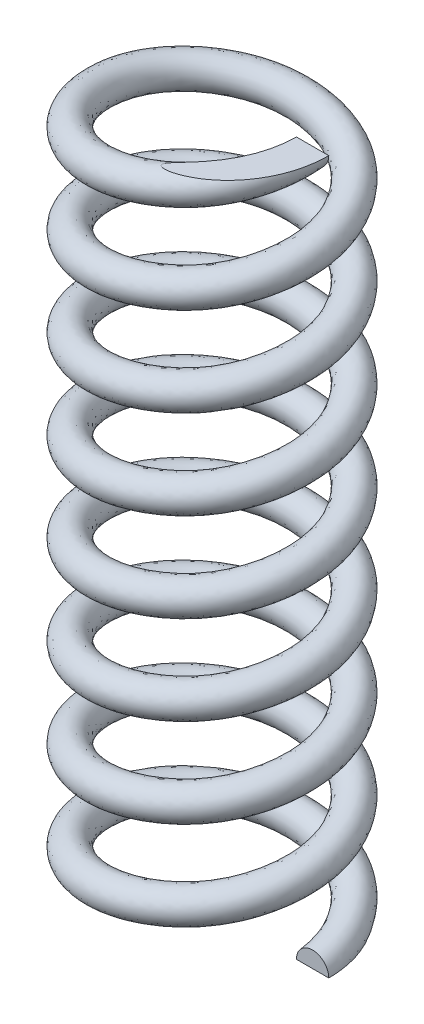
ISO-10303-21;
HEADER;
FILE_DESCRIPTION(('STEP AP214'),'2;1');
FILE_NAME('part.step','',(''),(''),'','','');
FILE_SCHEMA(('AUTOMOTIVE_DESIGN { 1 0 10303 214 1 1 1 1 }'));
ENDSEC;
DATA;
#1=APPLICATION_CONTEXT('core data for automotive mechanical design processes');
#2=APPLICATION_PROTOCOL_DEFINITION('international standard','automotive_design',2000,#1);
#3=PRODUCT_CONTEXT('',#1,'mechanical');
#4=PRODUCT('Part','Part','',(#3));
#5=PRODUCT_RELATED_PRODUCT_CATEGORY('part','',(#4));
#6=PRODUCT_DEFINITION_FORMATION('','',#4);
#7=PRODUCT_DEFINITION_CONTEXT('part definition',#1,'design');
#8=PRODUCT_DEFINITION('design','',#6,#7);
#9=PRODUCT_DEFINITION_SHAPE('','',#8);
#10=(LENGTH_UNIT() NAMED_UNIT(*) SI_UNIT(.MILLI.,.METRE.));
#11=(NAMED_UNIT(*) PLANE_ANGLE_UNIT() SI_UNIT($,.RADIAN.));
#12=(NAMED_UNIT(*) SI_UNIT($,.STERADIAN.) SOLID_ANGLE_UNIT());
#13=UNCERTAINTY_MEASURE_WITH_UNIT(LENGTH_MEASURE(1.E-05),#10,'distance_accuracy_value','');
#14=(GEOMETRIC_REPRESENTATION_CONTEXT(3) GLOBAL_UNCERTAINTY_ASSIGNED_CONTEXT((#13)) GLOBAL_UNIT_ASSIGNED_CONTEXT((#10,
#11,#12)) REPRESENTATION_CONTEXT('',''));
#15=CARTESIAN_POINT('',(0.,0.,0.));
#16=DIRECTION('',(0.,0.,1.));
#17=DIRECTION('',(1.,0.,0.));
#18=AXIS2_PLACEMENT_3D('',#15,#16,#17);
#19=CARTESIAN_POINT('',(7.2141540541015,28.1449932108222,-7.49999999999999));
#20=CARTESIAN_POINT('',(7.2141540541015,28.6033265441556,-11.6650937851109));
#21=CARTESIAN_POINT('',(3.60707702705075,29.0616598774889,-13.7476406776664));
#22=CARTESIAN_POINT('',(0.,29.5199932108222,-15.8301875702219));
#23=CARTESIAN_POINT('',(-3.60707702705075,29.9783265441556,-13.7476406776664));
#24=CARTESIAN_POINT('',(-7.21415405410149,30.4366598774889,-11.6650937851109));
#25=CARTESIAN_POINT('',(-7.2141540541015,30.8949932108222,-7.5));
#26=CARTESIAN_POINT('',(-7.2141540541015,31.3533265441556,-3.33490621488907));
#27=CARTESIAN_POINT('',(-3.60707702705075,31.8116598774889,-1.2523593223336));
#28=CARTESIAN_POINT('',(0.,32.2699932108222,0.830187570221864));
#29=CARTESIAN_POINT('',(3.60707702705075,32.7283265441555,-1.2523593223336));
#30=CARTESIAN_POINT('',(7.2141540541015,33.1866598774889,-3.33490621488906));
#31=CARTESIAN_POINT('',(7.2141540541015,33.6449932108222,-7.49999999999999));
#32=CARTESIAN_POINT('',(7.2141540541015,34.1033265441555,-11.6650937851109));
#33=CARTESIAN_POINT('',(3.60707702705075,34.5616598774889,-13.7476406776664));
#34=CARTESIAN_POINT('',(0.,35.0199932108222,-15.8301875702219));
#35=CARTESIAN_POINT('',(-3.60707702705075,35.4783265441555,-13.7476406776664));
#36=CARTESIAN_POINT('',(-7.21415405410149,35.9366598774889,-11.6650937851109));
#37=CARTESIAN_POINT('',(-7.2141540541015,36.3949932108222,-7.5));
#38=CARTESIAN_POINT('',(-7.2141540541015,36.8533265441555,-3.33490621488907));
#39=CARTESIAN_POINT('',(-3.60707702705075,37.3116598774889,-1.2523593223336));
#40=CARTESIAN_POINT('',(0.,37.7699932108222,0.830187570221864));
#41=CARTESIAN_POINT('',(3.60707702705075,38.2283265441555,-1.2523593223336));
#42=CARTESIAN_POINT('',(7.2141540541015,38.6866598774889,-3.33490621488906));
#43=CARTESIAN_POINT('',(7.2141540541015,39.1449932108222,-7.49999999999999));
#44=CARTESIAN_POINT('',(7.2141540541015,39.6033265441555,-11.6650937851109));
#45=CARTESIAN_POINT('',(3.60707702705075,40.0616598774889,-13.7476406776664));
#46=CARTESIAN_POINT('',(0.,40.5199932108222,-15.8301875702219));
#47=CARTESIAN_POINT('',(-3.60707702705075,40.9783265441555,-13.7476406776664));
#48=CARTESIAN_POINT('',(-7.21415405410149,41.4366598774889,-11.6650937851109));
#49=CARTESIAN_POINT('',(-7.2141540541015,41.8949932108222,-7.5));
#50=CARTESIAN_POINT('',(-7.2141540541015,42.3533265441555,-3.33490621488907));
#51=CARTESIAN_POINT('',(-3.60707702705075,42.8116598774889,-1.2523593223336));
#52=CARTESIAN_POINT('',(0.,43.2699932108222,0.830187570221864));
#53=CARTESIAN_POINT('',(3.60707702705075,43.7283265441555,-1.2523593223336));
#54=CARTESIAN_POINT('',(7.2141540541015,44.1866598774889,-3.33490621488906));
#55=CARTESIAN_POINT('',(7.2141540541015,44.6449932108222,-7.49999999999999));
#56=CARTESIAN_POINT('',(7.2141540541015,45.1033265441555,-11.6650937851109));
#57=CARTESIAN_POINT('',(3.60707702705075,45.5616598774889,-13.7476406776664));
#58=CARTESIAN_POINT('',(0.,46.0199932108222,-15.8301875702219));
#59=CARTESIAN_POINT('',(-3.60707702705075,46.4783265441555,-13.7476406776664));
#60=CARTESIAN_POINT('',(-7.21415405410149,46.9366598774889,-11.6650937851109));
#61=CARTESIAN_POINT('',(-7.2141540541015,47.3949932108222,-7.5));
#62=CARTESIAN_POINT('',(-7.2141540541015,47.8533265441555,-3.33490621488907));
#63=CARTESIAN_POINT('',(-3.60707702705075,48.3116598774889,-1.2523593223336));
#64=CARTESIAN_POINT('',(0.,48.7699932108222,0.830187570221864));
#65=CARTESIAN_POINT('',(3.60707702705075,49.2283265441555,-1.2523593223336));
#66=CARTESIAN_POINT('',(7.2141540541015,49.6866598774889,-3.33490621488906));
#67=CARTESIAN_POINT('',(7.2141540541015,50.1449932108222,-7.49999999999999));
#68=CARTESIAN_POINT('',(7.2141540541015,50.6033265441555,-11.6650937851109));
#69=CARTESIAN_POINT('',(3.60707702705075,51.0616598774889,-13.7476406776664));
#70=CARTESIAN_POINT('',(0.,51.5199932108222,-15.8301875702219));
#71=CARTESIAN_POINT('',(-3.60707702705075,51.9783265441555,-13.7476406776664));
#72=CARTESIAN_POINT('',(-7.21415405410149,52.4366598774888,-11.6650937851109));
#73=CARTESIAN_POINT('',(-7.2141540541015,52.8949932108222,-7.5));
#74=CARTESIAN_POINT('',(-7.2141540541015,53.3533265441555,-3.33490621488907));
#75=CARTESIAN_POINT('',(-3.60707702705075,53.8116598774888,-1.2523593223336));
#76=CARTESIAN_POINT('',(0.,54.2699932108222,0.830187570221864));
#77=CARTESIAN_POINT('',(3.60707702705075,54.7283265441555,-1.2523593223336));
#78=CARTESIAN_POINT('',(7.2141540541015,55.1866598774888,-3.33490621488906));
#79=CARTESIAN_POINT('',(7.2141540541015,55.6449932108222,-7.49999999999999));
#80=CARTESIAN_POINT('',(7.2141540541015,56.1033265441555,-11.6650937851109));
#81=CARTESIAN_POINT('',(3.60707702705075,56.5616598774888,-13.7476406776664));
#82=CARTESIAN_POINT('',(0.,57.0199932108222,-15.8301875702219));
#83=CARTESIAN_POINT('',(-3.60707702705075,57.4783265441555,-13.7476406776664));
#84=CARTESIAN_POINT('',(-7.21415405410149,57.9366598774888,-11.6650937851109));
#85=CARTESIAN_POINT('',(-7.2141540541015,58.3949932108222,-7.5));
#86=CARTESIAN_POINT('',(-7.2141540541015,58.8533265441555,-3.33490621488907));
#87=CARTESIAN_POINT('',(-3.60707702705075,59.3116598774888,-1.2523593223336));
#88=CARTESIAN_POINT('',(0.,59.7699932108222,0.830187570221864));
#89=CARTESIAN_POINT('',(3.60707702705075,60.2283265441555,-1.2523593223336));
#90=CARTESIAN_POINT('',(7.2141540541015,60.6866598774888,-3.33490621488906));
#91=CARTESIAN_POINT('',(7.2141540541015,61.1449932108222,-7.49999999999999));
#92=CARTESIAN_POINT('',(7.2141540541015,61.6033265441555,-11.6650937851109));
#93=CARTESIAN_POINT('',(3.60707702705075,62.0616598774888,-13.7476406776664));
#94=CARTESIAN_POINT('',(0.,62.5199932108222,-15.8301875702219));
#95=CARTESIAN_POINT('',(-3.60707702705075,62.9783265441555,-13.7476406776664));
#96=CARTESIAN_POINT('',(-7.21415405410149,63.4366598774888,-11.6650937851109));
#97=CARTESIAN_POINT('',(-7.2141540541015,63.8949932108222,-7.5));
#98=CARTESIAN_POINT('',(-7.2141540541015,64.3533265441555,-3.33490621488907));
#99=CARTESIAN_POINT('',(-3.60707702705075,64.8116598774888,-1.2523593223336));
#100=CARTESIAN_POINT('',(0.,65.2699932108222,0.830187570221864));
#101=CARTESIAN_POINT('',(3.60707702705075,65.7283265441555,-1.2523593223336));
#102=CARTESIAN_POINT('',(7.2141540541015,66.1866598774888,-3.33490621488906));
#103=CARTESIAN_POINT('',(7.2141540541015,66.6449932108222,-7.49999999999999));
#104=CARTESIAN_POINT('',(7.2141540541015,67.1033265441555,-11.6650937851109));
#105=CARTESIAN_POINT('',(3.60707702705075,67.5616598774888,-13.7476406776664));
#106=CARTESIAN_POINT('',(0.,68.0199932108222,-15.8301875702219));
#107=CARTESIAN_POINT('',(-3.60707702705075,68.4783265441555,-13.7476406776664));
#108=CARTESIAN_POINT('',(-7.21415405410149,68.9366598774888,-11.6650937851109));
#109=CARTESIAN_POINT('',(-7.2141540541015,69.3949932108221,-7.5));
#110=CARTESIAN_POINT('',(-7.2141540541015,69.8533265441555,-3.33490621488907));
#111=CARTESIAN_POINT('',(-3.60707702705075,70.3116598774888,-1.2523593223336));
#112=CARTESIAN_POINT('',(0.,70.7699932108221,0.830187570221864));
#113=CARTESIAN_POINT('',(3.60707702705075,71.2283265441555,-1.2523593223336));
#114=CARTESIAN_POINT('',(7.2141540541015,71.6866598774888,-3.33490621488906));
#115=CARTESIAN_POINT('',(7.2141540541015,72.1449932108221,-7.49999999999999));
#116=CARTESIAN_POINT('',(7.2141540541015,72.6033265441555,-11.6650937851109));
#117=CARTESIAN_POINT('',(3.60707702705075,73.0616598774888,-13.7476406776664));
#118=CARTESIAN_POINT('',(0.,73.5199932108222,-15.8301875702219));
#119=CARTESIAN_POINT('',(-3.60707702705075,73.9783265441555,-13.7476406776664));
#120=CARTESIAN_POINT('',(-7.21415405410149,74.4366598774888,-11.6650937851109));
#121=CARTESIAN_POINT('',(-7.2141540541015,74.8949932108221,-7.5));
#122=CARTESIAN_POINT('',(-7.2141540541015,75.3533265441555,-3.33490621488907));
#123=CARTESIAN_POINT('',(-3.60707702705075,75.8116598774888,-1.2523593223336));
#124=CARTESIAN_POINT('',(0.,76.2699932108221,0.830187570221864));
#125=CARTESIAN_POINT('',(3.60707702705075,76.7283265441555,-1.2523593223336));
#126=CARTESIAN_POINT('',(7.2141540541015,77.1866598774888,-3.33490621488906));
#127=CARTESIAN_POINT('',(7.2141540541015,77.6449932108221,-7.49999999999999));
#128=CARTESIAN_POINT('',(7.2141540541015,30.1449932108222,-7.49999999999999));
#129=CARTESIAN_POINT('',(7.2141540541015,30.6033265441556,-11.6650937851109));
#130=CARTESIAN_POINT('',(3.60707702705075,31.0616598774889,-13.7476406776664));
#131=CARTESIAN_POINT('',(0.,31.5199932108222,-15.8301875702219));
#132=CARTESIAN_POINT('',(-3.60707702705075,31.9783265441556,-13.7476406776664));
#133=CARTESIAN_POINT('',(-7.21415405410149,32.4366598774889,-11.6650937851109));
#134=CARTESIAN_POINT('',(-7.2141540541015,32.8949932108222,-7.5));
#135=CARTESIAN_POINT('',(-7.2141540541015,33.3533265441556,-3.33490621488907));
#136=CARTESIAN_POINT('',(-3.60707702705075,33.8116598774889,-1.2523593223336));
#137=CARTESIAN_POINT('',(0.,34.2699932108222,0.830187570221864));
#138=CARTESIAN_POINT('',(3.60707702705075,34.7283265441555,-1.2523593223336));
#139=CARTESIAN_POINT('',(7.2141540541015,35.1866598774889,-3.33490621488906));
#140=CARTESIAN_POINT('',(7.2141540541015,35.6449932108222,-7.49999999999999));
#141=CARTESIAN_POINT('',(7.2141540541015,36.1033265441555,-11.6650937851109));
#142=CARTESIAN_POINT('',(3.60707702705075,36.5616598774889,-13.7476406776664));
#143=CARTESIAN_POINT('',(0.,37.0199932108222,-15.8301875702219));
#144=CARTESIAN_POINT('',(-3.60707702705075,37.4783265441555,-13.7476406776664));
#145=CARTESIAN_POINT('',(-7.21415405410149,37.9366598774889,-11.6650937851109));
#146=CARTESIAN_POINT('',(-7.2141540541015,38.3949932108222,-7.5));
#147=CARTESIAN_POINT('',(-7.2141540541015,38.8533265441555,-3.33490621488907));
#148=CARTESIAN_POINT('',(-3.60707702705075,39.3116598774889,-1.2523593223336));
#149=CARTESIAN_POINT('',(0.,39.7699932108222,0.830187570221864));
#150=CARTESIAN_POINT('',(3.60707702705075,40.2283265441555,-1.2523593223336));
#151=CARTESIAN_POINT('',(7.2141540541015,40.6866598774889,-3.33490621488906));
#152=CARTESIAN_POINT('',(7.2141540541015,41.1449932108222,-7.49999999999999));
#153=CARTESIAN_POINT('',(7.2141540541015,41.6033265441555,-11.6650937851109));
#154=CARTESIAN_POINT('',(3.60707702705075,42.0616598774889,-13.7476406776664));
#155=CARTESIAN_POINT('',(0.,42.5199932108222,-15.8301875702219));
#156=CARTESIAN_POINT('',(-3.60707702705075,42.9783265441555,-13.7476406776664));
#157=CARTESIAN_POINT('',(-7.21415405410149,43.4366598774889,-11.6650937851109));
#158=CARTESIAN_POINT('',(-7.2141540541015,43.8949932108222,-7.5));
#159=CARTESIAN_POINT('',(-7.2141540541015,44.3533265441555,-3.33490621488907));
#160=CARTESIAN_POINT('',(-3.60707702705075,44.8116598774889,-1.2523593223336));
#161=CARTESIAN_POINT('',(0.,45.2699932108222,0.830187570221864));
#162=CARTESIAN_POINT('',(3.60707702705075,45.7283265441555,-1.2523593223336));
#163=CARTESIAN_POINT('',(7.2141540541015,46.1866598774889,-3.33490621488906));
#164=CARTESIAN_POINT('',(7.2141540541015,46.6449932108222,-7.49999999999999));
#165=CARTESIAN_POINT('',(7.2141540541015,47.1033265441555,-11.6650937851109));
#166=CARTESIAN_POINT('',(3.60707702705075,47.5616598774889,-13.7476406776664));
#167=CARTESIAN_POINT('',(0.,48.0199932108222,-15.8301875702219));
#168=CARTESIAN_POINT('',(-3.60707702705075,48.4783265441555,-13.7476406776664));
#169=CARTESIAN_POINT('',(-7.21415405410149,48.9366598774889,-11.6650937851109));
#170=CARTESIAN_POINT('',(-7.2141540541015,49.3949932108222,-7.5));
#171=CARTESIAN_POINT('',(-7.2141540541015,49.8533265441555,-3.33490621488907));
#172=CARTESIAN_POINT('',(-3.60707702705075,50.3116598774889,-1.2523593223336));
#173=CARTESIAN_POINT('',(0.,50.7699932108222,0.830187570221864));
#174=CARTESIAN_POINT('',(3.60707702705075,51.2283265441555,-1.2523593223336));
#175=CARTESIAN_POINT('',(7.2141540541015,51.6866598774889,-3.33490621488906));
#176=CARTESIAN_POINT('',(7.2141540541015,52.1449932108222,-7.49999999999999));
#177=CARTESIAN_POINT('',(7.2141540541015,52.6033265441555,-11.6650937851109));
#178=CARTESIAN_POINT('',(3.60707702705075,53.0616598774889,-13.7476406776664));
#179=CARTESIAN_POINT('',(0.,53.5199932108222,-15.8301875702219));
#180=CARTESIAN_POINT('',(-3.60707702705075,53.9783265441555,-13.7476406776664));
#181=CARTESIAN_POINT('',(-7.21415405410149,54.4366598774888,-11.6650937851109));
#182=CARTESIAN_POINT('',(-7.2141540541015,54.8949932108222,-7.5));
#183=CARTESIAN_POINT('',(-7.2141540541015,55.3533265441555,-3.33490621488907));
#184=CARTESIAN_POINT('',(-3.60707702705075,55.8116598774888,-1.2523593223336));
#185=CARTESIAN_POINT('',(0.,56.2699932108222,0.830187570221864));
#186=CARTESIAN_POINT('',(3.60707702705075,56.7283265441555,-1.2523593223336));
#187=CARTESIAN_POINT('',(7.2141540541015,57.1866598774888,-3.33490621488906));
#188=CARTESIAN_POINT('',(7.2141540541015,57.6449932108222,-7.49999999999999));
#189=CARTESIAN_POINT('',(7.2141540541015,58.1033265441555,-11.6650937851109));
#190=CARTESIAN_POINT('',(3.60707702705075,58.5616598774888,-13.7476406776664));
#191=CARTESIAN_POINT('',(0.,59.0199932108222,-15.8301875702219));
#192=CARTESIAN_POINT('',(-3.60707702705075,59.4783265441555,-13.7476406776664));
#193=CARTESIAN_POINT('',(-7.21415405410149,59.9366598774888,-11.6650937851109));
#194=CARTESIAN_POINT('',(-7.2141540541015,60.3949932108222,-7.5));
#195=CARTESIAN_POINT('',(-7.2141540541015,60.8533265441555,-3.33490621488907));
#196=CARTESIAN_POINT('',(-3.60707702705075,61.3116598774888,-1.2523593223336));
#197=CARTESIAN_POINT('',(0.,61.7699932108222,0.830187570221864));
#198=CARTESIAN_POINT('',(3.60707702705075,62.2283265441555,-1.2523593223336));
#199=CARTESIAN_POINT('',(7.2141540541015,62.6866598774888,-3.33490621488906));
#200=CARTESIAN_POINT('',(7.2141540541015,63.1449932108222,-7.49999999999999));
#201=CARTESIAN_POINT('',(7.2141540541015,63.6033265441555,-11.6650937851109));
#202=CARTESIAN_POINT('',(3.60707702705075,64.0616598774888,-13.7476406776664));
#203=CARTESIAN_POINT('',(0.,64.5199932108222,-15.8301875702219));
#204=CARTESIAN_POINT('',(-3.60707702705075,64.9783265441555,-13.7476406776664));
#205=CARTESIAN_POINT('',(-7.21415405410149,65.4366598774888,-11.6650937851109));
#206=CARTESIAN_POINT('',(-7.2141540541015,65.8949932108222,-7.5));
#207=CARTESIAN_POINT('',(-7.2141540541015,66.3533265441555,-3.33490621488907));
#208=CARTESIAN_POINT('',(-3.60707702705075,66.8116598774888,-1.2523593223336));
#209=CARTESIAN_POINT('',(0.,67.2699932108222,0.830187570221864));
#210=CARTESIAN_POINT('',(3.60707702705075,67.7283265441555,-1.2523593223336));
#211=CARTESIAN_POINT('',(7.2141540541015,68.1866598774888,-3.33490621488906));
#212=CARTESIAN_POINT('',(7.2141540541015,68.6449932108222,-7.49999999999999));
#213=CARTESIAN_POINT('',(7.2141540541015,69.1033265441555,-11.6650937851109));
#214=CARTESIAN_POINT('',(3.60707702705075,69.5616598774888,-13.7476406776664));
#215=CARTESIAN_POINT('',(0.,70.0199932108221,-15.8301875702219));
#216=CARTESIAN_POINT('',(-3.60707702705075,70.4783265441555,-13.7476406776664));
#217=CARTESIAN_POINT('',(-7.21415405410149,70.9366598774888,-11.6650937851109));
#218=CARTESIAN_POINT('',(-7.2141540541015,71.3949932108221,-7.5));
#219=CARTESIAN_POINT('',(-7.2141540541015,71.8533265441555,-3.33490621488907));
#220=CARTESIAN_POINT('',(-3.60707702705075,72.3116598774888,-1.2523593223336));
#221=CARTESIAN_POINT('',(0.,72.7699932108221,0.830187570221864));
#222=CARTESIAN_POINT('',(3.60707702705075,73.2283265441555,-1.2523593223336));
#223=CARTESIAN_POINT('',(7.2141540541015,73.6866598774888,-3.33490621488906));
#224=CARTESIAN_POINT('',(7.2141540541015,74.1449932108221,-7.49999999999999));
#225=CARTESIAN_POINT('',(7.2141540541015,74.6033265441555,-11.6650937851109));
#226=CARTESIAN_POINT('',(3.60707702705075,75.0616598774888,-13.7476406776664));
#227=CARTESIAN_POINT('',(0.,75.5199932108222,-15.8301875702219));
#228=CARTESIAN_POINT('',(-3.60707702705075,75.9783265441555,-13.7476406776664));
#229=CARTESIAN_POINT('',(-7.21415405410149,76.4366598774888,-11.6650937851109));
#230=CARTESIAN_POINT('',(-7.2141540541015,76.8949932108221,-7.5));
#231=CARTESIAN_POINT('',(-7.2141540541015,77.3533265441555,-3.33490621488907));
#232=CARTESIAN_POINT('',(-3.60707702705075,77.8116598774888,-1.2523593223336));
#233=CARTESIAN_POINT('',(0.,78.2699932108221,0.830187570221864));
#234=CARTESIAN_POINT('',(3.60707702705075,78.7283265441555,-1.2523593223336));
#235=CARTESIAN_POINT('',(7.2141540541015,79.1866598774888,-3.33490621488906));
#236=CARTESIAN_POINT('',(7.2141540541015,79.6449932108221,-7.49999999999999));
#237=CARTESIAN_POINT('',(5.2141540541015,30.1449932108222,-7.49999999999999));
#238=CARTESIAN_POINT('',(5.2141540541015,30.6033265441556,-10.5103932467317));
#239=CARTESIAN_POINT('',(2.60707702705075,31.0616598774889,-12.0155898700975));
#240=CARTESIAN_POINT('',(0.,31.5199932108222,-13.5207864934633));
#241=CARTESIAN_POINT('',(-2.60707702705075,31.9783265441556,-12.0155898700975));
#242=CARTESIAN_POINT('',(-5.21415405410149,32.4366598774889,-10.5103932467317));
#243=CARTESIAN_POINT('',(-5.2141540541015,32.8949932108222,-7.5));
#244=CARTESIAN_POINT('',(-5.2141540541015,33.3533265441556,-4.48960675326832));
#245=CARTESIAN_POINT('',(-2.60707702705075,33.8116598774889,-2.98441012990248));
#246=CARTESIAN_POINT('',(0.,34.2699932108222,-1.47921350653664));
#247=CARTESIAN_POINT('',(2.60707702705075,34.7283265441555,-2.98441012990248));
#248=CARTESIAN_POINT('',(5.2141540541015,35.1866598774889,-4.48960675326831));
#249=CARTESIAN_POINT('',(5.2141540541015,35.6449932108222,-7.49999999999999));
#250=CARTESIAN_POINT('',(5.2141540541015,36.1033265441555,-10.5103932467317));
#251=CARTESIAN_POINT('',(2.60707702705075,36.5616598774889,-12.0155898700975));
#252=CARTESIAN_POINT('',(0.,37.0199932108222,-13.5207864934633));
#253=CARTESIAN_POINT('',(-2.60707702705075,37.4783265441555,-12.0155898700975));
#254=CARTESIAN_POINT('',(-5.21415405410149,37.9366598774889,-10.5103932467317));
#255=CARTESIAN_POINT('',(-5.2141540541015,38.3949932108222,-7.5));
#256=CARTESIAN_POINT('',(-5.2141540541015,38.8533265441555,-4.48960675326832));
#257=CARTESIAN_POINT('',(-2.60707702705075,39.3116598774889,-2.98441012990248));
#258=CARTESIAN_POINT('',(0.,39.7699932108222,-1.47921350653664));
#259=CARTESIAN_POINT('',(2.60707702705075,40.2283265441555,-2.98441012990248));
#260=CARTESIAN_POINT('',(5.2141540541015,40.6866598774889,-4.48960675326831));
#261=CARTESIAN_POINT('',(5.2141540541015,41.1449932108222,-7.49999999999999));
#262=CARTESIAN_POINT('',(5.2141540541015,41.6033265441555,-10.5103932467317));
#263=CARTESIAN_POINT('',(2.60707702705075,42.0616598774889,-12.0155898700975));
#264=CARTESIAN_POINT('',(0.,42.5199932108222,-13.5207864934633));
#265=CARTESIAN_POINT('',(-2.60707702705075,42.9783265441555,-12.0155898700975));
#266=CARTESIAN_POINT('',(-5.21415405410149,43.4366598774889,-10.5103932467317));
#267=CARTESIAN_POINT('',(-5.2141540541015,43.8949932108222,-7.5));
#268=CARTESIAN_POINT('',(-5.2141540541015,44.3533265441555,-4.48960675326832));
#269=CARTESIAN_POINT('',(-2.60707702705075,44.8116598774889,-2.98441012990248));
#270=CARTESIAN_POINT('',(0.,45.2699932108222,-1.47921350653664));
#271=CARTESIAN_POINT('',(2.60707702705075,45.7283265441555,-2.98441012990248));
#272=CARTESIAN_POINT('',(5.2141540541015,46.1866598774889,-4.48960675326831));
#273=CARTESIAN_POINT('',(5.2141540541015,46.6449932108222,-7.49999999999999));
#274=CARTESIAN_POINT('',(5.2141540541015,47.1033265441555,-10.5103932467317));
#275=CARTESIAN_POINT('',(2.60707702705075,47.5616598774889,-12.0155898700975));
#276=CARTESIAN_POINT('',(0.,48.0199932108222,-13.5207864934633));
#277=CARTESIAN_POINT('',(-2.60707702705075,48.4783265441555,-12.0155898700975));
#278=CARTESIAN_POINT('',(-5.21415405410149,48.9366598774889,-10.5103932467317));
#279=CARTESIAN_POINT('',(-5.2141540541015,49.3949932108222,-7.5));
#280=CARTESIAN_POINT('',(-5.2141540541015,49.8533265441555,-4.48960675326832));
#281=CARTESIAN_POINT('',(-2.60707702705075,50.3116598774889,-2.98441012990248));
#282=CARTESIAN_POINT('',(0.,50.7699932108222,-1.47921350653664));
#283=CARTESIAN_POINT('',(2.60707702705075,51.2283265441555,-2.98441012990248));
#284=CARTESIAN_POINT('',(5.2141540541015,51.6866598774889,-4.48960675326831));
#285=CARTESIAN_POINT('',(5.2141540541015,52.1449932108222,-7.49999999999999));
#286=CARTESIAN_POINT('',(5.2141540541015,52.6033265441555,-10.5103932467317));
#287=CARTESIAN_POINT('',(2.60707702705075,53.0616598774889,-12.0155898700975));
#288=CARTESIAN_POINT('',(0.,53.5199932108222,-13.5207864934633));
#289=CARTESIAN_POINT('',(-2.60707702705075,53.9783265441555,-12.0155898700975));
#290=CARTESIAN_POINT('',(-5.21415405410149,54.4366598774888,-10.5103932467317));
#291=CARTESIAN_POINT('',(-5.2141540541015,54.8949932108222,-7.5));
#292=CARTESIAN_POINT('',(-5.2141540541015,55.3533265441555,-4.48960675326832));
#293=CARTESIAN_POINT('',(-2.60707702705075,55.8116598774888,-2.98441012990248));
#294=CARTESIAN_POINT('',(0.,56.2699932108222,-1.47921350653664));
#295=CARTESIAN_POINT('',(2.60707702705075,56.7283265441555,-2.98441012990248));
#296=CARTESIAN_POINT('',(5.2141540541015,57.1866598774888,-4.48960675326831));
#297=CARTESIAN_POINT('',(5.2141540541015,57.6449932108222,-7.49999999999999));
#298=CARTESIAN_POINT('',(5.2141540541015,58.1033265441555,-10.5103932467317));
#299=CARTESIAN_POINT('',(2.60707702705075,58.5616598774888,-12.0155898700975));
#300=CARTESIAN_POINT('',(0.,59.0199932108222,-13.5207864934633));
#301=CARTESIAN_POINT('',(-2.60707702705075,59.4783265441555,-12.0155898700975));
#302=CARTESIAN_POINT('',(-5.21415405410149,59.9366598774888,-10.5103932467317));
#303=CARTESIAN_POINT('',(-5.2141540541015,60.3949932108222,-7.5));
#304=CARTESIAN_POINT('',(-5.2141540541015,60.8533265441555,-4.48960675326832));
#305=CARTESIAN_POINT('',(-2.60707702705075,61.3116598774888,-2.98441012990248));
#306=CARTESIAN_POINT('',(0.,61.7699932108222,-1.47921350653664));
#307=CARTESIAN_POINT('',(2.60707702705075,62.2283265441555,-2.98441012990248));
#308=CARTESIAN_POINT('',(5.2141540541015,62.6866598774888,-4.48960675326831));
#309=CARTESIAN_POINT('',(5.2141540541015,63.1449932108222,-7.49999999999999));
#310=CARTESIAN_POINT('',(5.2141540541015,63.6033265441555,-10.5103932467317));
#311=CARTESIAN_POINT('',(2.60707702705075,64.0616598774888,-12.0155898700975));
#312=CARTESIAN_POINT('',(0.,64.5199932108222,-13.5207864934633));
#313=CARTESIAN_POINT('',(-2.60707702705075,64.9783265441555,-12.0155898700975));
#314=CARTESIAN_POINT('',(-5.21415405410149,65.4366598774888,-10.5103932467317));
#315=CARTESIAN_POINT('',(-5.2141540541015,65.8949932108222,-7.5));
#316=CARTESIAN_POINT('',(-5.2141540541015,66.3533265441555,-4.48960675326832));
#317=CARTESIAN_POINT('',(-2.60707702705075,66.8116598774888,-2.98441012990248));
#318=CARTESIAN_POINT('',(0.,67.2699932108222,-1.47921350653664));
#319=CARTESIAN_POINT('',(2.60707702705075,67.7283265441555,-2.98441012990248));
#320=CARTESIAN_POINT('',(5.2141540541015,68.1866598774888,-4.48960675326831));
#321=CARTESIAN_POINT('',(5.2141540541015,68.6449932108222,-7.49999999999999));
#322=CARTESIAN_POINT('',(5.2141540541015,69.1033265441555,-10.5103932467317));
#323=CARTESIAN_POINT('',(2.60707702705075,69.5616598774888,-12.0155898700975));
#324=CARTESIAN_POINT('',(0.,70.0199932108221,-13.5207864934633));
#325=CARTESIAN_POINT('',(-2.60707702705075,70.4783265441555,-12.0155898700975));
#326=CARTESIAN_POINT('',(-5.21415405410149,70.9366598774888,-10.5103932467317));
#327=CARTESIAN_POINT('',(-5.2141540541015,71.3949932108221,-7.5));
#328=CARTESIAN_POINT('',(-5.2141540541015,71.8533265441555,-4.48960675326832));
#329=CARTESIAN_POINT('',(-2.60707702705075,72.3116598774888,-2.98441012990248));
#330=CARTESIAN_POINT('',(0.,72.7699932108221,-1.47921350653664));
#331=CARTESIAN_POINT('',(2.60707702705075,73.2283265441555,-2.98441012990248));
#332=CARTESIAN_POINT('',(5.2141540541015,73.6866598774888,-4.48960675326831));
#333=CARTESIAN_POINT('',(5.2141540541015,74.1449932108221,-7.49999999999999));
#334=CARTESIAN_POINT('',(5.2141540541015,74.6033265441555,-10.5103932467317));
#335=CARTESIAN_POINT('',(2.60707702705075,75.0616598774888,-12.0155898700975));
#336=CARTESIAN_POINT('',(0.,75.5199932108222,-13.5207864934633));
#337=CARTESIAN_POINT('',(-2.60707702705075,75.9783265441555,-12.0155898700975));
#338=CARTESIAN_POINT('',(-5.21415405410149,76.4366598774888,-10.5103932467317));
#339=CARTESIAN_POINT('',(-5.2141540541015,76.8949932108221,-7.5));
#340=CARTESIAN_POINT('',(-5.2141540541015,77.3533265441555,-4.48960675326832));
#341=CARTESIAN_POINT('',(-2.60707702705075,77.8116598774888,-2.98441012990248));
#342=CARTESIAN_POINT('',(0.,78.2699932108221,-1.47921350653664));
#343=CARTESIAN_POINT('',(2.60707702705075,78.7283265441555,-2.98441012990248));
#344=CARTESIAN_POINT('',(5.2141540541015,79.1866598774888,-4.48960675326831));
#345=CARTESIAN_POINT('',(5.2141540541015,79.6449932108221,-7.49999999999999));
#346=CARTESIAN_POINT('',(5.2141540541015,28.1449932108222,-7.49999999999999));
#347=CARTESIAN_POINT('',(5.2141540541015,28.6033265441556,-10.5103932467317));
#348=CARTESIAN_POINT('',(2.60707702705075,29.0616598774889,-12.0155898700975));
#349=CARTESIAN_POINT('',(0.,29.5199932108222,-13.5207864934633));
#350=CARTESIAN_POINT('',(-2.60707702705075,29.9783265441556,-12.0155898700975));
#351=CARTESIAN_POINT('',(-5.21415405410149,30.4366598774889,-10.5103932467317));
#352=CARTESIAN_POINT('',(-5.2141540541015,30.8949932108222,-7.5));
#353=CARTESIAN_POINT('',(-5.2141540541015,31.3533265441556,-4.48960675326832));
#354=CARTESIAN_POINT('',(-2.60707702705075,31.8116598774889,-2.98441012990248));
#355=CARTESIAN_POINT('',(0.,32.2699932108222,-1.47921350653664));
#356=CARTESIAN_POINT('',(2.60707702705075,32.7283265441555,-2.98441012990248));
#357=CARTESIAN_POINT('',(5.2141540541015,33.1866598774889,-4.48960675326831));
#358=CARTESIAN_POINT('',(5.2141540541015,33.6449932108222,-7.49999999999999));
#359=CARTESIAN_POINT('',(5.2141540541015,34.1033265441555,-10.5103932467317));
#360=CARTESIAN_POINT('',(2.60707702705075,34.5616598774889,-12.0155898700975));
#361=CARTESIAN_POINT('',(0.,35.0199932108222,-13.5207864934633));
#362=CARTESIAN_POINT('',(-2.60707702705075,35.4783265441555,-12.0155898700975));
#363=CARTESIAN_POINT('',(-5.21415405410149,35.9366598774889,-10.5103932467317));
#364=CARTESIAN_POINT('',(-5.2141540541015,36.3949932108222,-7.5));
#365=CARTESIAN_POINT('',(-5.2141540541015,36.8533265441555,-4.48960675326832));
#366=CARTESIAN_POINT('',(-2.60707702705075,37.3116598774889,-2.98441012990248));
#367=CARTESIAN_POINT('',(0.,37.7699932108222,-1.47921350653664));
#368=CARTESIAN_POINT('',(2.60707702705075,38.2283265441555,-2.98441012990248));
#369=CARTESIAN_POINT('',(5.2141540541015,38.6866598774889,-4.48960675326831));
#370=CARTESIAN_POINT('',(5.2141540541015,39.1449932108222,-7.49999999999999));
#371=CARTESIAN_POINT('',(5.2141540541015,39.6033265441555,-10.5103932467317));
#372=CARTESIAN_POINT('',(2.60707702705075,40.0616598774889,-12.0155898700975));
#373=CARTESIAN_POINT('',(0.,40.5199932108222,-13.5207864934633));
#374=CARTESIAN_POINT('',(-2.60707702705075,40.9783265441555,-12.0155898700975));
#375=CARTESIAN_POINT('',(-5.21415405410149,41.4366598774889,-10.5103932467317));
#376=CARTESIAN_POINT('',(-5.2141540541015,41.8949932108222,-7.5));
#377=CARTESIAN_POINT('',(-5.2141540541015,42.3533265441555,-4.48960675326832));
#378=CARTESIAN_POINT('',(-2.60707702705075,42.8116598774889,-2.98441012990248));
#379=CARTESIAN_POINT('',(0.,43.2699932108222,-1.47921350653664));
#380=CARTESIAN_POINT('',(2.60707702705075,43.7283265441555,-2.98441012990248));
#381=CARTESIAN_POINT('',(5.2141540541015,44.1866598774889,-4.48960675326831));
#382=CARTESIAN_POINT('',(5.2141540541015,44.6449932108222,-7.49999999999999));
#383=CARTESIAN_POINT('',(5.2141540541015,45.1033265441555,-10.5103932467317));
#384=CARTESIAN_POINT('',(2.60707702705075,45.5616598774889,-12.0155898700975));
#385=CARTESIAN_POINT('',(0.,46.0199932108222,-13.5207864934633));
#386=CARTESIAN_POINT('',(-2.60707702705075,46.4783265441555,-12.0155898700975));
#387=CARTESIAN_POINT('',(-5.21415405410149,46.9366598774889,-10.5103932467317));
#388=CARTESIAN_POINT('',(-5.2141540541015,47.3949932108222,-7.5));
#389=CARTESIAN_POINT('',(-5.2141540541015,47.8533265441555,-4.48960675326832));
#390=CARTESIAN_POINT('',(-2.60707702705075,48.3116598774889,-2.98441012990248));
#391=CARTESIAN_POINT('',(0.,48.7699932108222,-1.47921350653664));
#392=CARTESIAN_POINT('',(2.60707702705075,49.2283265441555,-2.98441012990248));
#393=CARTESIAN_POINT('',(5.2141540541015,49.6866598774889,-4.48960675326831));
#394=CARTESIAN_POINT('',(5.2141540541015,50.1449932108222,-7.49999999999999));
#395=CARTESIAN_POINT('',(5.2141540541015,50.6033265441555,-10.5103932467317));
#396=CARTESIAN_POINT('',(2.60707702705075,51.0616598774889,-12.0155898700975));
#397=CARTESIAN_POINT('',(0.,51.5199932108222,-13.5207864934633));
#398=CARTESIAN_POINT('',(-2.60707702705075,51.9783265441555,-12.0155898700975));
#399=CARTESIAN_POINT('',(-5.21415405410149,52.4366598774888,-10.5103932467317));
#400=CARTESIAN_POINT('',(-5.2141540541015,52.8949932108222,-7.5));
#401=CARTESIAN_POINT('',(-5.2141540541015,53.3533265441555,-4.48960675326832));
#402=CARTESIAN_POINT('',(-2.60707702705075,53.8116598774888,-2.98441012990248));
#403=CARTESIAN_POINT('',(0.,54.2699932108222,-1.47921350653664));
#404=CARTESIAN_POINT('',(2.60707702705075,54.7283265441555,-2.98441012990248));
#405=CARTESIAN_POINT('',(5.2141540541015,55.1866598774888,-4.48960675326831));
#406=CARTESIAN_POINT('',(5.2141540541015,55.6449932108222,-7.49999999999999));
#407=CARTESIAN_POINT('',(5.2141540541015,56.1033265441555,-10.5103932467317));
#408=CARTESIAN_POINT('',(2.60707702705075,56.5616598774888,-12.0155898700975));
#409=CARTESIAN_POINT('',(0.,57.0199932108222,-13.5207864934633));
#410=CARTESIAN_POINT('',(-2.60707702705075,57.4783265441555,-12.0155898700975));
#411=CARTESIAN_POINT('',(-5.21415405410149,57.9366598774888,-10.5103932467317));
#412=CARTESIAN_POINT('',(-5.2141540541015,58.3949932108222,-7.5));
#413=CARTESIAN_POINT('',(-5.2141540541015,58.8533265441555,-4.48960675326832));
#414=CARTESIAN_POINT('',(-2.60707702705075,59.3116598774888,-2.98441012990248));
#415=CARTESIAN_POINT('',(0.,59.7699932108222,-1.47921350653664));
#416=CARTESIAN_POINT('',(2.60707702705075,60.2283265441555,-2.98441012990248));
#417=CARTESIAN_POINT('',(5.2141540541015,60.6866598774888,-4.48960675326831));
#418=CARTESIAN_POINT('',(5.2141540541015,61.1449932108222,-7.49999999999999));
#419=CARTESIAN_POINT('',(5.2141540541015,61.6033265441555,-10.5103932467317));
#420=CARTESIAN_POINT('',(2.60707702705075,62.0616598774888,-12.0155898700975));
#421=CARTESIAN_POINT('',(0.,62.5199932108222,-13.5207864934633));
#422=CARTESIAN_POINT('',(-2.60707702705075,62.9783265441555,-12.0155898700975));
#423=CARTESIAN_POINT('',(-5.21415405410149,63.4366598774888,-10.5103932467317));
#424=CARTESIAN_POINT('',(-5.2141540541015,63.8949932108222,-7.5));
#425=CARTESIAN_POINT('',(-5.2141540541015,64.3533265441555,-4.48960675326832));
#426=CARTESIAN_POINT('',(-2.60707702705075,64.8116598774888,-2.98441012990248));
#427=CARTESIAN_POINT('',(0.,65.2699932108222,-1.47921350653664));
#428=CARTESIAN_POINT('',(2.60707702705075,65.7283265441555,-2.98441012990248));
#429=CARTESIAN_POINT('',(5.2141540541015,66.1866598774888,-4.48960675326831));
#430=CARTESIAN_POINT('',(5.2141540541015,66.6449932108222,-7.49999999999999));
#431=CARTESIAN_POINT('',(5.2141540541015,67.1033265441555,-10.5103932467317));
#432=CARTESIAN_POINT('',(2.60707702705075,67.5616598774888,-12.0155898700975));
#433=CARTESIAN_POINT('',(0.,68.0199932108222,-13.5207864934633));
#434=CARTESIAN_POINT('',(-2.60707702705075,68.4783265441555,-12.0155898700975));
#435=CARTESIAN_POINT('',(-5.21415405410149,68.9366598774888,-10.5103932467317));
#436=CARTESIAN_POINT('',(-5.2141540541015,69.3949932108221,-7.5));
#437=CARTESIAN_POINT('',(-5.2141540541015,69.8533265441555,-4.48960675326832));
#438=CARTESIAN_POINT('',(-2.60707702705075,70.3116598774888,-2.98441012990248));
#439=CARTESIAN_POINT('',(0.,70.7699932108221,-1.47921350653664));
#440=CARTESIAN_POINT('',(2.60707702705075,71.2283265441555,-2.98441012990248));
#441=CARTESIAN_POINT('',(5.2141540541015,71.6866598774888,-4.48960675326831));
#442=CARTESIAN_POINT('',(5.2141540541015,72.1449932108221,-7.49999999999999));
#443=CARTESIAN_POINT('',(5.2141540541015,72.6033265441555,-10.5103932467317));
#444=CARTESIAN_POINT('',(2.60707702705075,73.0616598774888,-12.0155898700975));
#445=CARTESIAN_POINT('',(0.,73.5199932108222,-13.5207864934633));
#446=CARTESIAN_POINT('',(-2.60707702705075,73.9783265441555,-12.0155898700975));
#447=CARTESIAN_POINT('',(-5.21415405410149,74.4366598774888,-10.5103932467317));
#448=CARTESIAN_POINT('',(-5.2141540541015,74.8949932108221,-7.5));
#449=CARTESIAN_POINT('',(-5.2141540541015,75.3533265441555,-4.48960675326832));
#450=CARTESIAN_POINT('',(-2.60707702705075,75.8116598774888,-2.98441012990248));
#451=CARTESIAN_POINT('',(0.,76.2699932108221,-1.47921350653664));
#452=CARTESIAN_POINT('',(2.60707702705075,76.7283265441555,-2.98441012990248));
#453=CARTESIAN_POINT('',(5.2141540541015,77.1866598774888,-4.48960675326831));
#454=CARTESIAN_POINT('',(5.2141540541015,77.6449932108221,-7.49999999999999));
#455=CARTESIAN_POINT('',(5.2141540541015,26.1449932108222,-7.49999999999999));
#456=CARTESIAN_POINT('',(5.2141540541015,26.6033265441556,-10.5103932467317));
#457=CARTESIAN_POINT('',(2.60707702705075,27.0616598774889,-12.0155898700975));
#458=CARTESIAN_POINT('',(0.,27.5199932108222,-13.5207864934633));
#459=CARTESIAN_POINT('',(-2.60707702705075,27.9783265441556,-12.0155898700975));
#460=CARTESIAN_POINT('',(-5.21415405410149,28.4366598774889,-10.5103932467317));
#461=CARTESIAN_POINT('',(-5.2141540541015,28.8949932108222,-7.5));
#462=CARTESIAN_POINT('',(-5.2141540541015,29.3533265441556,-4.48960675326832));
#463=CARTESIAN_POINT('',(-2.60707702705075,29.8116598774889,-2.98441012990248));
#464=CARTESIAN_POINT('',(0.,30.2699932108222,-1.47921350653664));
#465=CARTESIAN_POINT('',(2.60707702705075,30.7283265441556,-2.98441012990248));
#466=CARTESIAN_POINT('',(5.2141540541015,31.1866598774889,-4.48960675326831));
#467=CARTESIAN_POINT('',(5.2141540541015,31.6449932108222,-7.49999999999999));
#468=CARTESIAN_POINT('',(5.2141540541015,32.1033265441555,-10.5103932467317));
#469=CARTESIAN_POINT('',(2.60707702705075,32.5616598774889,-12.0155898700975));
#470=CARTESIAN_POINT('',(0.,33.0199932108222,-13.5207864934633));
#471=CARTESIAN_POINT('',(-2.60707702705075,33.4783265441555,-12.0155898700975));
#472=CARTESIAN_POINT('',(-5.21415405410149,33.9366598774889,-10.5103932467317));
#473=CARTESIAN_POINT('',(-5.2141540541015,34.3949932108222,-7.5));
#474=CARTESIAN_POINT('',(-5.2141540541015,34.8533265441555,-4.48960675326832));
#475=CARTESIAN_POINT('',(-2.60707702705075,35.3116598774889,-2.98441012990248));
#476=CARTESIAN_POINT('',(0.,35.7699932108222,-1.47921350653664));
#477=CARTESIAN_POINT('',(2.60707702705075,36.2283265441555,-2.98441012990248));
#478=CARTESIAN_POINT('',(5.2141540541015,36.6866598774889,-4.48960675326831));
#479=CARTESIAN_POINT('',(5.2141540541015,37.1449932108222,-7.49999999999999));
#480=CARTESIAN_POINT('',(5.2141540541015,37.6033265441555,-10.5103932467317));
#481=CARTESIAN_POINT('',(2.60707702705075,38.0616598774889,-12.0155898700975));
#482=CARTESIAN_POINT('',(0.,38.5199932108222,-13.5207864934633));
#483=CARTESIAN_POINT('',(-2.60707702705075,38.9783265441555,-12.0155898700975));
#484=CARTESIAN_POINT('',(-5.21415405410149,39.4366598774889,-10.5103932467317));
#485=CARTESIAN_POINT('',(-5.2141540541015,39.8949932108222,-7.5));
#486=CARTESIAN_POINT('',(-5.2141540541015,40.3533265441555,-4.48960675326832));
#487=CARTESIAN_POINT('',(-2.60707702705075,40.8116598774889,-2.98441012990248));
#488=CARTESIAN_POINT('',(0.,41.2699932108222,-1.47921350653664));
#489=CARTESIAN_POINT('',(2.60707702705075,41.7283265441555,-2.98441012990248));
#490=CARTESIAN_POINT('',(5.2141540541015,42.1866598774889,-4.48960675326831));
#491=CARTESIAN_POINT('',(5.2141540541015,42.6449932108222,-7.49999999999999));
#492=CARTESIAN_POINT('',(5.2141540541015,43.1033265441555,-10.5103932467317));
#493=CARTESIAN_POINT('',(2.60707702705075,43.5616598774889,-12.0155898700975));
#494=CARTESIAN_POINT('',(0.,44.0199932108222,-13.5207864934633));
#495=CARTESIAN_POINT('',(-2.60707702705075,44.4783265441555,-12.0155898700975));
#496=CARTESIAN_POINT('',(-5.21415405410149,44.9366598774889,-10.5103932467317));
#497=CARTESIAN_POINT('',(-5.2141540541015,45.3949932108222,-7.5));
#498=CARTESIAN_POINT('',(-5.2141540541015,45.8533265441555,-4.48960675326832));
#499=CARTESIAN_POINT('',(-2.60707702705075,46.3116598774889,-2.98441012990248));
#500=CARTESIAN_POINT('',(0.,46.7699932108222,-1.47921350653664));
#501=CARTESIAN_POINT('',(2.60707702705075,47.2283265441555,-2.98441012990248));
#502=CARTESIAN_POINT('',(5.2141540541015,47.6866598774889,-4.48960675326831));
#503=CARTESIAN_POINT('',(5.2141540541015,48.1449932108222,-7.49999999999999));
#504=CARTESIAN_POINT('',(5.2141540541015,48.6033265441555,-10.5103932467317));
#505=CARTESIAN_POINT('',(2.60707702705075,49.0616598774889,-12.0155898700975));
#506=CARTESIAN_POINT('',(0.,49.5199932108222,-13.5207864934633));
#507=CARTESIAN_POINT('',(-2.60707702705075,49.9783265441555,-12.0155898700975));
#508=CARTESIAN_POINT('',(-5.21415405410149,50.4366598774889,-10.5103932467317));
#509=CARTESIAN_POINT('',(-5.2141540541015,50.8949932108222,-7.5));
#510=CARTESIAN_POINT('',(-5.2141540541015,51.3533265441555,-4.48960675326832));
#511=CARTESIAN_POINT('',(-2.60707702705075,51.8116598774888,-2.98441012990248));
#512=CARTESIAN_POINT('',(0.,52.2699932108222,-1.47921350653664));
#513=CARTESIAN_POINT('',(2.60707702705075,52.7283265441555,-2.98441012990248));
#514=CARTESIAN_POINT('',(5.2141540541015,53.1866598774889,-4.48960675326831));
#515=CARTESIAN_POINT('',(5.2141540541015,53.6449932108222,-7.49999999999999));
#516=CARTESIAN_POINT('',(5.2141540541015,54.1033265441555,-10.5103932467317));
#517=CARTESIAN_POINT('',(2.60707702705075,54.5616598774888,-12.0155898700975));
#518=CARTESIAN_POINT('',(0.,55.0199932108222,-13.5207864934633));
#519=CARTESIAN_POINT('',(-2.60707702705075,55.4783265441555,-12.0155898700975));
#520=CARTESIAN_POINT('',(-5.21415405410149,55.9366598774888,-10.5103932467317));
#521=CARTESIAN_POINT('',(-5.2141540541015,56.3949932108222,-7.5));
#522=CARTESIAN_POINT('',(-5.2141540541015,56.8533265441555,-4.48960675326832));
#523=CARTESIAN_POINT('',(-2.60707702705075,57.3116598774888,-2.98441012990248));
#524=CARTESIAN_POINT('',(0.,57.7699932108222,-1.47921350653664));
#525=CARTESIAN_POINT('',(2.60707702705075,58.2283265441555,-2.98441012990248));
#526=CARTESIAN_POINT('',(5.2141540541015,58.6866598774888,-4.48960675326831));
#527=CARTESIAN_POINT('',(5.2141540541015,59.1449932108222,-7.49999999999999));
#528=CARTESIAN_POINT('',(5.2141540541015,59.6033265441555,-10.5103932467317));
#529=CARTESIAN_POINT('',(2.60707702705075,60.0616598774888,-12.0155898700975));
#530=CARTESIAN_POINT('',(0.,60.5199932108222,-13.5207864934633));
#531=CARTESIAN_POINT('',(-2.60707702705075,60.9783265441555,-12.0155898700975));
#532=CARTESIAN_POINT('',(-5.21415405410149,61.4366598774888,-10.5103932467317));
#533=CARTESIAN_POINT('',(-5.2141540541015,61.8949932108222,-7.5));
#534=CARTESIAN_POINT('',(-5.2141540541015,62.3533265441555,-4.48960675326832));
#535=CARTESIAN_POINT('',(-2.60707702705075,62.8116598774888,-2.98441012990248));
#536=CARTESIAN_POINT('',(0.,63.2699932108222,-1.47921350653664));
#537=CARTESIAN_POINT('',(2.60707702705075,63.7283265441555,-2.98441012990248));
#538=CARTESIAN_POINT('',(5.2141540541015,64.1866598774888,-4.48960675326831));
#539=CARTESIAN_POINT('',(5.2141540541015,64.6449932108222,-7.49999999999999));
#540=CARTESIAN_POINT('',(5.2141540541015,65.1033265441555,-10.5103932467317));
#541=CARTESIAN_POINT('',(2.60707702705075,65.5616598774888,-12.0155898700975));
#542=CARTESIAN_POINT('',(0.,66.0199932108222,-13.5207864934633));
#543=CARTESIAN_POINT('',(-2.60707702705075,66.4783265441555,-12.0155898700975));
#544=CARTESIAN_POINT('',(-5.21415405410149,66.9366598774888,-10.5103932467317));
#545=CARTESIAN_POINT('',(-5.2141540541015,67.3949932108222,-7.5));
#546=CARTESIAN_POINT('',(-5.2141540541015,67.8533265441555,-4.48960675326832));
#547=CARTESIAN_POINT('',(-2.60707702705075,68.3116598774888,-2.98441012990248));
#548=CARTESIAN_POINT('',(0.,68.7699932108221,-1.47921350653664));
#549=CARTESIAN_POINT('',(2.60707702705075,69.2283265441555,-2.98441012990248));
#550=CARTESIAN_POINT('',(5.2141540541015,69.6866598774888,-4.48960675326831));
#551=CARTESIAN_POINT('',(5.2141540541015,70.1449932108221,-7.49999999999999));
#552=CARTESIAN_POINT('',(5.2141540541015,70.6033265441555,-10.5103932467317));
#553=CARTESIAN_POINT('',(2.60707702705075,71.0616598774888,-12.0155898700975));
#554=CARTESIAN_POINT('',(0.,71.5199932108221,-13.5207864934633));
#555=CARTESIAN_POINT('',(-2.60707702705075,71.9783265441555,-12.0155898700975));
#556=CARTESIAN_POINT('',(-5.21415405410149,72.4366598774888,-10.5103932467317));
#557=CARTESIAN_POINT('',(-5.2141540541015,72.8949932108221,-7.5));
#558=CARTESIAN_POINT('',(-5.2141540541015,73.3533265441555,-4.48960675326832));
#559=CARTESIAN_POINT('',(-2.60707702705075,73.8116598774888,-2.98441012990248));
#560=CARTESIAN_POINT('',(0.,74.2699932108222,-1.47921350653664));
#561=CARTESIAN_POINT('',(2.60707702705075,74.7283265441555,-2.98441012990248));
#562=CARTESIAN_POINT('',(5.2141540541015,75.1866598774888,-4.48960675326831));
#563=CARTESIAN_POINT('',(5.2141540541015,75.6449932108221,-7.49999999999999));
#564=CARTESIAN_POINT('',(7.2141540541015,26.1449932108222,-7.49999999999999));
#565=CARTESIAN_POINT('',(7.2141540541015,26.6033265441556,-11.6650937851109));
#566=CARTESIAN_POINT('',(3.60707702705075,27.0616598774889,-13.7476406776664));
#567=CARTESIAN_POINT('',(0.,27.5199932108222,-15.8301875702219));
#568=CARTESIAN_POINT('',(-3.60707702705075,27.9783265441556,-13.7476406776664));
#569=CARTESIAN_POINT('',(-7.21415405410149,28.4366598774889,-11.6650937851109));
#570=CARTESIAN_POINT('',(-7.2141540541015,28.8949932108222,-7.5));
#571=CARTESIAN_POINT('',(-7.2141540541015,29.3533265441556,-3.33490621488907));
#572=CARTESIAN_POINT('',(-3.60707702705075,29.8116598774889,-1.2523593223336));
#573=CARTESIAN_POINT('',(0.,30.2699932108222,0.830187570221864));
#574=CARTESIAN_POINT('',(3.60707702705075,30.7283265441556,-1.2523593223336));
#575=CARTESIAN_POINT('',(7.2141540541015,31.1866598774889,-3.33490621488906));
#576=CARTESIAN_POINT('',(7.2141540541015,31.6449932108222,-7.49999999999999));
#577=CARTESIAN_POINT('',(7.2141540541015,32.1033265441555,-11.6650937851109));
#578=CARTESIAN_POINT('',(3.60707702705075,32.5616598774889,-13.7476406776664));
#579=CARTESIAN_POINT('',(0.,33.0199932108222,-15.8301875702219));
#580=CARTESIAN_POINT('',(-3.60707702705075,33.4783265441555,-13.7476406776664));
#581=CARTESIAN_POINT('',(-7.21415405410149,33.9366598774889,-11.6650937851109));
#582=CARTESIAN_POINT('',(-7.2141540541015,34.3949932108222,-7.5));
#583=CARTESIAN_POINT('',(-7.2141540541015,34.8533265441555,-3.33490621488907));
#584=CARTESIAN_POINT('',(-3.60707702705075,35.3116598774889,-1.2523593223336));
#585=CARTESIAN_POINT('',(0.,35.7699932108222,0.830187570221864));
#586=CARTESIAN_POINT('',(3.60707702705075,36.2283265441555,-1.2523593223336));
#587=CARTESIAN_POINT('',(7.2141540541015,36.6866598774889,-3.33490621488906));
#588=CARTESIAN_POINT('',(7.2141540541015,37.1449932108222,-7.49999999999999));
#589=CARTESIAN_POINT('',(7.2141540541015,37.6033265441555,-11.6650937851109));
#590=CARTESIAN_POINT('',(3.60707702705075,38.0616598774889,-13.7476406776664));
#591=CARTESIAN_POINT('',(0.,38.5199932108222,-15.8301875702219));
#592=CARTESIAN_POINT('',(-3.60707702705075,38.9783265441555,-13.7476406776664));
#593=CARTESIAN_POINT('',(-7.21415405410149,39.4366598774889,-11.6650937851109));
#594=CARTESIAN_POINT('',(-7.2141540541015,39.8949932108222,-7.5));
#595=CARTESIAN_POINT('',(-7.2141540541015,40.3533265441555,-3.33490621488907));
#596=CARTESIAN_POINT('',(-3.60707702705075,40.8116598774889,-1.2523593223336));
#597=CARTESIAN_POINT('',(0.,41.2699932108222,0.830187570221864));
#598=CARTESIAN_POINT('',(3.60707702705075,41.7283265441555,-1.2523593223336));
#599=CARTESIAN_POINT('',(7.2141540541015,42.1866598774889,-3.33490621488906));
#600=CARTESIAN_POINT('',(7.2141540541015,42.6449932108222,-7.49999999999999));
#601=CARTESIAN_POINT('',(7.2141540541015,43.1033265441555,-11.6650937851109));
#602=CARTESIAN_POINT('',(3.60707702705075,43.5616598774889,-13.7476406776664));
#603=CARTESIAN_POINT('',(0.,44.0199932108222,-15.8301875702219));
#604=CARTESIAN_POINT('',(-3.60707702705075,44.4783265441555,-13.7476406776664));
#605=CARTESIAN_POINT('',(-7.21415405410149,44.9366598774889,-11.6650937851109));
#606=CARTESIAN_POINT('',(-7.2141540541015,45.3949932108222,-7.5));
#607=CARTESIAN_POINT('',(-7.2141540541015,45.8533265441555,-3.33490621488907));
#608=CARTESIAN_POINT('',(-3.60707702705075,46.3116598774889,-1.2523593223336));
#609=CARTESIAN_POINT('',(0.,46.7699932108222,0.830187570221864));
#610=CARTESIAN_POINT('',(3.60707702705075,47.2283265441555,-1.2523593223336));
#611=CARTESIAN_POINT('',(7.2141540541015,47.6866598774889,-3.33490621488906));
#612=CARTESIAN_POINT('',(7.2141540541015,48.1449932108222,-7.49999999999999));
#613=CARTESIAN_POINT('',(7.2141540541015,48.6033265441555,-11.6650937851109));
#614=CARTESIAN_POINT('',(3.60707702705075,49.0616598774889,-13.7476406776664));
#615=CARTESIAN_POINT('',(0.,49.5199932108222,-15.8301875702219));
#616=CARTESIAN_POINT('',(-3.60707702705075,49.9783265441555,-13.7476406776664));
#617=CARTESIAN_POINT('',(-7.21415405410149,50.4366598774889,-11.6650937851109));
#618=CARTESIAN_POINT('',(-7.2141540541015,50.8949932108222,-7.5));
#619=CARTESIAN_POINT('',(-7.2141540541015,51.3533265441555,-3.33490621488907));
#620=CARTESIAN_POINT('',(-3.60707702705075,51.8116598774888,-1.2523593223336));
#621=CARTESIAN_POINT('',(0.,52.2699932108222,0.830187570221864));
#622=CARTESIAN_POINT('',(3.60707702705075,52.7283265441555,-1.2523593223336));
#623=CARTESIAN_POINT('',(7.2141540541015,53.1866598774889,-3.33490621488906));
#624=CARTESIAN_POINT('',(7.2141540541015,53.6449932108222,-7.49999999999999));
#625=CARTESIAN_POINT('',(7.2141540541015,54.1033265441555,-11.6650937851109));
#626=CARTESIAN_POINT('',(3.60707702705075,54.5616598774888,-13.7476406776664));
#627=CARTESIAN_POINT('',(0.,55.0199932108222,-15.8301875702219));
#628=CARTESIAN_POINT('',(-3.60707702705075,55.4783265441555,-13.7476406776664));
#629=CARTESIAN_POINT('',(-7.21415405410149,55.9366598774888,-11.6650937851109));
#630=CARTESIAN_POINT('',(-7.2141540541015,56.3949932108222,-7.5));
#631=CARTESIAN_POINT('',(-7.2141540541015,56.8533265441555,-3.33490621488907));
#632=CARTESIAN_POINT('',(-3.60707702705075,57.3116598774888,-1.2523593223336));
#633=CARTESIAN_POINT('',(0.,57.7699932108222,0.830187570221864));
#634=CARTESIAN_POINT('',(3.60707702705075,58.2283265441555,-1.2523593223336));
#635=CARTESIAN_POINT('',(7.2141540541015,58.6866598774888,-3.33490621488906));
#636=CARTESIAN_POINT('',(7.2141540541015,59.1449932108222,-7.49999999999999));
#637=CARTESIAN_POINT('',(7.2141540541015,59.6033265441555,-11.6650937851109));
#638=CARTESIAN_POINT('',(3.60707702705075,60.0616598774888,-13.7476406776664));
#639=CARTESIAN_POINT('',(0.,60.5199932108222,-15.8301875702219));
#640=CARTESIAN_POINT('',(-3.60707702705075,60.9783265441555,-13.7476406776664));
#641=CARTESIAN_POINT('',(-7.21415405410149,61.4366598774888,-11.6650937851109));
#642=CARTESIAN_POINT('',(-7.2141540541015,61.8949932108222,-7.5));
#643=CARTESIAN_POINT('',(-7.2141540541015,62.3533265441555,-3.33490621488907));
#644=CARTESIAN_POINT('',(-3.60707702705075,62.8116598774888,-1.2523593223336));
#645=CARTESIAN_POINT('',(0.,63.2699932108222,0.830187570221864));
#646=CARTESIAN_POINT('',(3.60707702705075,63.7283265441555,-1.2523593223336));
#647=CARTESIAN_POINT('',(7.2141540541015,64.1866598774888,-3.33490621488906));
#648=CARTESIAN_POINT('',(7.2141540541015,64.6449932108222,-7.49999999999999));
#649=CARTESIAN_POINT('',(7.2141540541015,65.1033265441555,-11.6650937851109));
#650=CARTESIAN_POINT('',(3.60707702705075,65.5616598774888,-13.7476406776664));
#651=CARTESIAN_POINT('',(0.,66.0199932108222,-15.8301875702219));
#652=CARTESIAN_POINT('',(-3.60707702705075,66.4783265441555,-13.7476406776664));
#653=CARTESIAN_POINT('',(-7.21415405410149,66.9366598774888,-11.6650937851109));
#654=CARTESIAN_POINT('',(-7.2141540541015,67.3949932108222,-7.5));
#655=CARTESIAN_POINT('',(-7.2141540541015,67.8533265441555,-3.33490621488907));
#656=CARTESIAN_POINT('',(-3.60707702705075,68.3116598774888,-1.2523593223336));
#657=CARTESIAN_POINT('',(0.,68.7699932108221,0.830187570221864));
#658=CARTESIAN_POINT('',(3.60707702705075,69.2283265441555,-1.2523593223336));
#659=CARTESIAN_POINT('',(7.2141540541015,69.6866598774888,-3.33490621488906));
#660=CARTESIAN_POINT('',(7.2141540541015,70.1449932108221,-7.49999999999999));
#661=CARTESIAN_POINT('',(7.2141540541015,70.6033265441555,-11.6650937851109));
#662=CARTESIAN_POINT('',(3.60707702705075,71.0616598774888,-13.7476406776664));
#663=CARTESIAN_POINT('',(0.,71.5199932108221,-15.8301875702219));
#664=CARTESIAN_POINT('',(-3.60707702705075,71.9783265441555,-13.7476406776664));
#665=CARTESIAN_POINT('',(-7.21415405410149,72.4366598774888,-11.6650937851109));
#666=CARTESIAN_POINT('',(-7.2141540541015,72.8949932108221,-7.5));
#667=CARTESIAN_POINT('',(-7.2141540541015,73.3533265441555,-3.33490621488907));
#668=CARTESIAN_POINT('',(-3.60707702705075,73.8116598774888,-1.2523593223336));
#669=CARTESIAN_POINT('',(0.,74.2699932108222,0.830187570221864));
#670=CARTESIAN_POINT('',(3.60707702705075,74.7283265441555,-1.2523593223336));
#671=CARTESIAN_POINT('',(7.2141540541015,75.1866598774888,-3.33490621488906));
#672=CARTESIAN_POINT('',(7.2141540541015,75.6449932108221,-7.49999999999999));
#673=CARTESIAN_POINT('',(7.2141540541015,28.1449932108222,-7.49999999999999));
#674=CARTESIAN_POINT('',(7.2141540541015,28.6033265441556,-11.6650937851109));
#675=CARTESIAN_POINT('',(3.60707702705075,29.0616598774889,-13.7476406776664));
#676=CARTESIAN_POINT('',(0.,29.5199932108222,-15.8301875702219));
#677=CARTESIAN_POINT('',(-3.60707702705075,29.9783265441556,-13.7476406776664));
#678=CARTESIAN_POINT('',(-7.21415405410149,30.4366598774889,-11.6650937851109));
#679=CARTESIAN_POINT('',(-7.2141540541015,30.8949932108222,-7.5));
#680=CARTESIAN_POINT('',(-7.2141540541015,31.3533265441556,-3.33490621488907));
#681=CARTESIAN_POINT('',(-3.60707702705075,31.8116598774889,-1.2523593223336));
#682=CARTESIAN_POINT('',(0.,32.2699932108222,0.830187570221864));
#683=CARTESIAN_POINT('',(3.60707702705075,32.7283265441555,-1.2523593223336));
#684=CARTESIAN_POINT('',(7.2141540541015,33.1866598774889,-3.33490621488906));
#685=CARTESIAN_POINT('',(7.2141540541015,33.6449932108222,-7.49999999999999));
#686=CARTESIAN_POINT('',(7.2141540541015,34.1033265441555,-11.6650937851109));
#687=CARTESIAN_POINT('',(3.60707702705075,34.5616598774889,-13.7476406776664));
#688=CARTESIAN_POINT('',(0.,35.0199932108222,-15.8301875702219));
#689=CARTESIAN_POINT('',(-3.60707702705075,35.4783265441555,-13.7476406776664));
#690=CARTESIAN_POINT('',(-7.21415405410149,35.9366598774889,-11.6650937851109));
#691=CARTESIAN_POINT('',(-7.2141540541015,36.3949932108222,-7.5));
#692=CARTESIAN_POINT('',(-7.2141540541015,36.8533265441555,-3.33490621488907));
#693=CARTESIAN_POINT('',(-3.60707702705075,37.3116598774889,-1.2523593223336));
#694=CARTESIAN_POINT('',(0.,37.7699932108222,0.830187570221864));
#695=CARTESIAN_POINT('',(3.60707702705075,38.2283265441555,-1.2523593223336));
#696=CARTESIAN_POINT('',(7.2141540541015,38.6866598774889,-3.33490621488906));
#697=CARTESIAN_POINT('',(7.2141540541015,39.1449932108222,-7.49999999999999));
#698=CARTESIAN_POINT('',(7.2141540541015,39.6033265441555,-11.6650937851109));
#699=CARTESIAN_POINT('',(3.60707702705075,40.0616598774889,-13.7476406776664));
#700=CARTESIAN_POINT('',(0.,40.5199932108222,-15.8301875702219));
#701=CARTESIAN_POINT('',(-3.60707702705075,40.9783265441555,-13.7476406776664));
#702=CARTESIAN_POINT('',(-7.21415405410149,41.4366598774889,-11.6650937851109));
#703=CARTESIAN_POINT('',(-7.2141540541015,41.8949932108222,-7.5));
#704=CARTESIAN_POINT('',(-7.2141540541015,42.3533265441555,-3.33490621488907));
#705=CARTESIAN_POINT('',(-3.60707702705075,42.8116598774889,-1.2523593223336));
#706=CARTESIAN_POINT('',(0.,43.2699932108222,0.830187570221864));
#707=CARTESIAN_POINT('',(3.60707702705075,43.7283265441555,-1.2523593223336));
#708=CARTESIAN_POINT('',(7.2141540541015,44.1866598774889,-3.33490621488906));
#709=CARTESIAN_POINT('',(7.2141540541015,44.6449932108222,-7.49999999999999));
#710=CARTESIAN_POINT('',(7.2141540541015,45.1033265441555,-11.6650937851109));
#711=CARTESIAN_POINT('',(3.60707702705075,45.5616598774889,-13.7476406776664));
#712=CARTESIAN_POINT('',(0.,46.0199932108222,-15.8301875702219));
#713=CARTESIAN_POINT('',(-3.60707702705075,46.4783265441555,-13.7476406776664));
#714=CARTESIAN_POINT('',(-7.21415405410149,46.9366598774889,-11.6650937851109));
#715=CARTESIAN_POINT('',(-7.2141540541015,47.3949932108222,-7.5));
#716=CARTESIAN_POINT('',(-7.2141540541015,47.8533265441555,-3.33490621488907));
#717=CARTESIAN_POINT('',(-3.60707702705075,48.3116598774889,-1.2523593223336));
#718=CARTESIAN_POINT('',(0.,48.7699932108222,0.830187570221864));
#719=CARTESIAN_POINT('',(3.60707702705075,49.2283265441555,-1.2523593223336));
#720=CARTESIAN_POINT('',(7.2141540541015,49.6866598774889,-3.33490621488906));
#721=CARTESIAN_POINT('',(7.2141540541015,50.1449932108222,-7.49999999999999));
#722=CARTESIAN_POINT('',(7.2141540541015,50.6033265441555,-11.6650937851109));
#723=CARTESIAN_POINT('',(3.60707702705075,51.0616598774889,-13.7476406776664));
#724=CARTESIAN_POINT('',(0.,51.5199932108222,-15.8301875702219));
#725=CARTESIAN_POINT('',(-3.60707702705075,51.9783265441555,-13.7476406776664));
#726=CARTESIAN_POINT('',(-7.21415405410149,52.4366598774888,-11.6650937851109));
#727=CARTESIAN_POINT('',(-7.2141540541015,52.8949932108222,-7.5));
#728=CARTESIAN_POINT('',(-7.2141540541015,53.3533265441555,-3.33490621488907));
#729=CARTESIAN_POINT('',(-3.60707702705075,53.8116598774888,-1.2523593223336));
#730=CARTESIAN_POINT('',(0.,54.2699932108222,0.830187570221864));
#731=CARTESIAN_POINT('',(3.60707702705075,54.7283265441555,-1.2523593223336));
#732=CARTESIAN_POINT('',(7.2141540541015,55.1866598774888,-3.33490621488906));
#733=CARTESIAN_POINT('',(7.2141540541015,55.6449932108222,-7.49999999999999));
#734=CARTESIAN_POINT('',(7.2141540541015,56.1033265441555,-11.6650937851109));
#735=CARTESIAN_POINT('',(3.60707702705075,56.5616598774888,-13.7476406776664));
#736=CARTESIAN_POINT('',(0.,57.0199932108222,-15.8301875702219));
#737=CARTESIAN_POINT('',(-3.60707702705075,57.4783265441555,-13.7476406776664));
#738=CARTESIAN_POINT('',(-7.21415405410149,57.9366598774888,-11.6650937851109));
#739=CARTESIAN_POINT('',(-7.2141540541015,58.3949932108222,-7.5));
#740=CARTESIAN_POINT('',(-7.2141540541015,58.8533265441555,-3.33490621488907));
#741=CARTESIAN_POINT('',(-3.60707702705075,59.3116598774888,-1.2523593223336));
#742=CARTESIAN_POINT('',(0.,59.7699932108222,0.830187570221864));
#743=CARTESIAN_POINT('',(3.60707702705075,60.2283265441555,-1.2523593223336));
#744=CARTESIAN_POINT('',(7.2141540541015,60.6866598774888,-3.33490621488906));
#745=CARTESIAN_POINT('',(7.2141540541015,61.1449932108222,-7.49999999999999));
#746=CARTESIAN_POINT('',(7.2141540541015,61.6033265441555,-11.6650937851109));
#747=CARTESIAN_POINT('',(3.60707702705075,62.0616598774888,-13.7476406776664));
#748=CARTESIAN_POINT('',(0.,62.5199932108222,-15.8301875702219));
#749=CARTESIAN_POINT('',(-3.60707702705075,62.9783265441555,-13.7476406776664));
#750=CARTESIAN_POINT('',(-7.21415405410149,63.4366598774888,-11.6650937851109));
#751=CARTESIAN_POINT('',(-7.2141540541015,63.8949932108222,-7.5));
#752=CARTESIAN_POINT('',(-7.2141540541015,64.3533265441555,-3.33490621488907));
#753=CARTESIAN_POINT('',(-3.60707702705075,64.8116598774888,-1.2523593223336));
#754=CARTESIAN_POINT('',(0.,65.2699932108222,0.830187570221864));
#755=CARTESIAN_POINT('',(3.60707702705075,65.7283265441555,-1.2523593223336));
#756=CARTESIAN_POINT('',(7.2141540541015,66.1866598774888,-3.33490621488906));
#757=CARTESIAN_POINT('',(7.2141540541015,66.6449932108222,-7.49999999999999));
#758=CARTESIAN_POINT('',(7.2141540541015,67.1033265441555,-11.6650937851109));
#759=CARTESIAN_POINT('',(3.60707702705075,67.5616598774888,-13.7476406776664));
#760=CARTESIAN_POINT('',(0.,68.0199932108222,-15.8301875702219));
#761=CARTESIAN_POINT('',(-3.60707702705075,68.4783265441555,-13.7476406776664));
#762=CARTESIAN_POINT('',(-7.21415405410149,68.9366598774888,-11.6650937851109));
#763=CARTESIAN_POINT('',(-7.2141540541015,69.3949932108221,-7.5));
#764=CARTESIAN_POINT('',(-7.2141540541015,69.8533265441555,-3.33490621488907));
#765=CARTESIAN_POINT('',(-3.60707702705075,70.3116598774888,-1.2523593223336));
#766=CARTESIAN_POINT('',(0.,70.7699932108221,0.830187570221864));
#767=CARTESIAN_POINT('',(3.60707702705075,71.2283265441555,-1.2523593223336));
#768=CARTESIAN_POINT('',(7.2141540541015,71.6866598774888,-3.33490621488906));
#769=CARTESIAN_POINT('',(7.2141540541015,72.1449932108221,-7.49999999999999));
#770=CARTESIAN_POINT('',(7.2141540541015,72.6033265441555,-11.6650937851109));
#771=CARTESIAN_POINT('',(3.60707702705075,73.0616598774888,-13.7476406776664));
#772=CARTESIAN_POINT('',(0.,73.5199932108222,-15.8301875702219));
#773=CARTESIAN_POINT('',(-3.60707702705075,73.9783265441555,-13.7476406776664));
#774=CARTESIAN_POINT('',(-7.21415405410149,74.4366598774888,-11.6650937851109));
#775=CARTESIAN_POINT('',(-7.2141540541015,74.8949932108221,-7.5));
#776=CARTESIAN_POINT('',(-7.2141540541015,75.3533265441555,-3.33490621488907));
#777=CARTESIAN_POINT('',(-3.60707702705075,75.8116598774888,-1.2523593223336));
#778=CARTESIAN_POINT('',(0.,76.2699932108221,0.830187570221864));
#779=CARTESIAN_POINT('',(3.60707702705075,76.7283265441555,-1.2523593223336));
#780=CARTESIAN_POINT('',(7.2141540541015,77.1866598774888,-3.33490621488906));
#781=CARTESIAN_POINT('',(7.2141540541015,77.6449932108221,-7.49999999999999));
#782=(BOUNDED_SURFACE() B_SPLINE_SURFACE(3,2,((#19,#20,#21,#22,#23,#24,#25,#26,#27,#28,#29,#30,
#31,#32,#33,#34,#35,#36,#37,#38,#39,#40,#41,#42,#43,#44,#45,#46,#47,#48,#49,#50,#51,#52,#53,#54,
#55,#56,#57,#58,#59,#60,#61,#62,#63,#64,#65,#66,#67,#68,#69,#70,#71,#72,#73,#74,#75,#76,#77,#78,
#79,#80,#81,#82,#83,#84,#85,#86,#87,#88,#89,#90,#91,#92,#93,#94,#95,#96,#97,#98,#99,#100,#101,
#102,#103,#104,#105,#106,#107,#108,#109,#110,#111,#112,#113,#114,#115,#116,#117,#118,#119,#120,
#121,#122,#123,#124,#125,#126,#127),(#128,#129,#130,#131,#132,#133,#134,#135,#136,#137,#138,
#139,#140,#141,#142,#143,#144,#145,#146,#147,#148,#149,#150,#151,#152,#153,#154,#155,#156,#157,
#158,#159,#160,#161,#162,#163,#164,#165,#166,#167,#168,#169,#170,#171,#172,#173,#174,#175,#176,
#177,#178,#179,#180,#181,#182,#183,#184,#185,#186,#187,#188,#189,#190,#191,#192,#193,#194,#195,
#196,#197,#198,#199,#200,#201,#202,#203,#204,#205,#206,#207,#208,#209,#210,#211,#212,#213,#214,
#215,#216,#217,#218,#219,#220,#221,#222,#223,#224,#225,#226,#227,#228,#229,#230,#231,#232,#233,
#234,#235,#236),(#237,#238,#239,#240,#241,#242,#243,#244,#245,#246,#247,#248,#249,#250,#251,
#252,#253,#254,#255,#256,#257,#258,#259,#260,#261,#262,#263,#264,#265,#266,#267,#268,#269,#270,
#271,#272,#273,#274,#275,#276,#277,#278,#279,#280,#281,#282,#283,#284,#285,#286,#287,#288,#289,
#290,#291,#292,#293,#294,#295,#296,#297,#298,#299,#300,#301,#302,#303,#304,#305,#306,#307,#308,
#309,#310,#311,#312,#313,#314,#315,#316,#317,#318,#319,#320,#321,#322,#323,#324,#325,#326,#327,
#328,#329,#330,#331,#332,#333,#334,#335,#336,#337,#338,#339,#340,#341,#342,#343,#344,#345),
(#346,#347,#348,#349,#350,#351,#352,#353,#354,#355,#356,#357,#358,#359,#360,#361,#362,#363,#364,
#365,#366,#367,#368,#369,#370,#371,#372,#373,#374,#375,#376,#377,#378,#379,#380,#381,#382,#383,
#384,#385,#386,#387,#388,#389,#390,#391,#392,#393,#394,#395,#396,#397,#398,#399,#400,#401,#402,
#403,#404,#405,#406,#407,#408,#409,#410,#411,#412,#413,#414,#415,#416,#417,#418,#419,#420,#421,
#422,#423,#424,#425,#426,#427,#428,#429,#430,#431,#432,#433,#434,#435,#436,#437,#438,#439,#440,
#441,#442,#443,#444,#445,#446,#447,#448,#449,#450,#451,#452,#453,#454),(#455,#456,#457,#458,
#459,#460,#461,#462,#463,#464,#465,#466,#467,#468,#469,#470,#471,#472,#473,#474,#475,#476,#477,
#478,#479,#480,#481,#482,#483,#484,#485,#486,#487,#488,#489,#490,#491,#492,#493,#494,#495,#496,
#497,#498,#499,#500,#501,#502,#503,#504,#505,#506,#507,#508,#509,#510,#511,#512,#513,#514,#515,
#516,#517,#518,#519,#520,#521,#522,#523,#524,#525,#526,#527,#528,#529,#530,#531,#532,#533,#534,
#535,#536,#537,#538,#539,#540,#541,#542,#543,#544,#545,#546,#547,#548,#549,#550,#551,#552,#553,
#554,#555,#556,#557,#558,#559,#560,#561,#562,#563),(#564,#565,#566,#567,#568,#569,#570,#571,
#572,#573,#574,#575,#576,#577,#578,#579,#580,#581,#582,#583,#584,#585,#586,#587,#588,#589,#590,
#591,#592,#593,#594,#595,#596,#597,#598,#599,#600,#601,#602,#603,#604,#605,#606,#607,#608,#609,
#610,#611,#612,#613,#614,#615,#616,#617,#618,#619,#620,#621,#622,#623,#624,#625,#626,#627,#628,
#629,#630,#631,#632,#633,#634,#635,#636,#637,#638,#639,#640,#641,#642,#643,#644,#645,#646,#647,
#648,#649,#650,#651,#652,#653,#654,#655,#656,#657,#658,#659,#660,#661,#662,#663,#664,#665,#666,
#667,#668,#669,#670,#671,#672),(#673,#674,#675,#676,#677,#678,#679,#680,#681,#682,#683,#684,
#685,#686,#687,#688,#689,#690,#691,#692,#693,#694,#695,#696,#697,#698,#699,#700,#701,#702,#703,
#704,#705,#706,#707,#708,#709,#710,#711,#712,#713,#714,#715,#716,#717,#718,#719,#720,#721,#722,
#723,#724,#725,#726,#727,#728,#729,#730,#731,#732,#733,#734,#735,#736,#737,#738,#739,#740,#741,
#742,#743,#744,#745,#746,#747,#748,#749,#750,#751,#752,#753,#754,#755,#756,#757,#758,#759,#760,
#761,#762,#763,#764,#765,#766,#767,#768,#769,#770,#771,#772,#773,#774,#775,#776,#777,#778,#779,
#780,#781)),.UNSPECIFIED.,.T.,.F.,.F.) B_SPLINE_SURFACE_WITH_KNOTS((4,3,4),(3,2,2,2,2,2,2,2,2,2,
2,2,2,2,2,2,2,2,2,2,2,2,2,2,2,2,2,2,2,2,2,2,2,2,2,2,2,2,2,2,2,2,2,2,2,2,2,2,2,2,2,2,2,2,3),(0.,
0.5,1.),(0.,0.0185185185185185,0.037037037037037,0.0555555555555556,0.0740740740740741,
0.0925925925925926,0.111111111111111,0.12962962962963,0.148148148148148,0.166666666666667,
0.185185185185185,0.203703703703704,0.222222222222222,0.240740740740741,0.259259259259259,
0.277777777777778,0.296296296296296,0.314814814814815,0.333333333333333,0.351851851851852,
0.37037037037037,0.388888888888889,0.407407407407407,0.425925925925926,0.444444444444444,
0.462962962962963,0.481481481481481,0.5,0.518518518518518,0.537037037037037,0.555555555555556,
0.574074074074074,0.592592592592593,0.611111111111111,0.62962962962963,0.648148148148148,
0.666666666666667,0.685185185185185,0.703703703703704,0.722222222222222,0.740740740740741,
0.759259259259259,0.777777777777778,0.796296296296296,0.814814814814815,0.833333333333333,
0.851851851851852,0.87037037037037,0.888888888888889,0.907407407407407,0.925925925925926,
0.944444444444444,0.962962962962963,0.981481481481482,1.),
.UNSPECIFIED.) GEOMETRIC_REPRESENTATION_ITEM() RATIONAL_B_SPLINE_SURFACE(((1.,0.866025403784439,
1.,0.866025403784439,1.,0.866025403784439,1.,0.866025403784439,1.,0.866025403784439,1.,
0.866025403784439,1.,0.866025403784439,1.,0.866025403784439,1.,0.866025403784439,1.,
0.866025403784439,1.,0.866025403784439,1.,0.866025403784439,1.,0.866025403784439,1.,
0.866025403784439,1.,0.866025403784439,1.,0.866025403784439,1.,0.866025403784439,1.,
0.866025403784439,1.,0.866025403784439,1.,0.866025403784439,1.,0.866025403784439,1.,
0.866025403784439,1.,0.866025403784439,1.,0.866025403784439,1.,0.866025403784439,1.,
0.866025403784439,1.,0.866025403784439,1.,0.866025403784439,1.,0.866025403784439,1.,
0.866025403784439,1.,0.866025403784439,1.,0.866025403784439,1.,0.866025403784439,1.,
0.866025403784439,1.,0.866025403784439,1.,0.866025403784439,1.,0.866025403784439,1.,
0.866025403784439,1.,0.866025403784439,1.,0.866025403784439,1.,0.866025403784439,1.,
0.866025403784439,1.,0.866025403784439,1.,0.866025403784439,1.,0.866025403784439,1.,
0.866025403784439,1.,0.866025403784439,1.,0.866025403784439,1.,0.866025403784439,1.,
0.866025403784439,1.,0.866025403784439,1.,0.866025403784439,1.,0.866025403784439,1.,
0.866025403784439,1.),(0.333333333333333,0.288675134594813,0.333333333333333,0.288675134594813,
0.333333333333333,0.288675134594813,0.333333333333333,0.288675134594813,0.333333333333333,
0.288675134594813,0.333333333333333,0.288675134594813,0.333333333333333,0.288675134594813,
0.333333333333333,0.288675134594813,0.333333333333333,0.288675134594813,0.333333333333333,
0.288675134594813,0.333333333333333,0.288675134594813,0.333333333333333,0.288675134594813,
0.333333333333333,0.288675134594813,0.333333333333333,0.288675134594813,0.333333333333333,
0.288675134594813,0.333333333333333,0.288675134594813,0.333333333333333,0.288675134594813,
0.333333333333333,0.288675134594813,0.333333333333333,0.288675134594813,0.333333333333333,
0.288675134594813,0.333333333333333,0.288675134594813,0.333333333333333,0.288675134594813,
0.333333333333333,0.288675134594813,0.333333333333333,0.288675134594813,0.333333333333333,
0.288675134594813,0.333333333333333,0.288675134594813,0.333333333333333,0.288675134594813,
0.333333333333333,0.288675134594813,0.333333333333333,0.288675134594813,0.333333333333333,
0.288675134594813,0.333333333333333,0.288675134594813,0.333333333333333,0.288675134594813,
0.333333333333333,0.288675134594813,0.333333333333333,0.288675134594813,0.333333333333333,
0.288675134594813,0.333333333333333,0.288675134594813,0.333333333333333,0.288675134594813,
0.333333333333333,0.288675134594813,0.333333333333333,0.288675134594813,0.333333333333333,
0.288675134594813,0.333333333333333,0.288675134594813,0.333333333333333,0.288675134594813,
0.333333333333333,0.288675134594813,0.333333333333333,0.288675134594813,0.333333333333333,
0.288675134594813,0.333333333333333,0.288675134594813,0.333333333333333,0.288675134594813,
0.333333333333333,0.288675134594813,0.333333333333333,0.288675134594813,0.333333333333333,
0.288675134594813,0.333333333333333,0.288675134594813,0.333333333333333,0.288675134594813,
0.333333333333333,0.288675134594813,0.333333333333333,0.288675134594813,0.333333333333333),
(0.333333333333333,0.288675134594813,0.333333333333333,0.288675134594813,0.333333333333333,
0.288675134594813,0.333333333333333,0.288675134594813,0.333333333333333,0.288675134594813,
0.333333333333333,0.288675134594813,0.333333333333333,0.288675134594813,0.333333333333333,
0.288675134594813,0.333333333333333,0.288675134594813,0.333333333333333,0.288675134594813,
0.333333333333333,0.288675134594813,0.333333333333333,0.288675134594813,0.333333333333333,
0.288675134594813,0.333333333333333,0.288675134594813,0.333333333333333,0.288675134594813,
0.333333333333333,0.288675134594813,0.333333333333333,0.288675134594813,0.333333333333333,
0.288675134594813,0.333333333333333,0.288675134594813,0.333333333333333,0.288675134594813,
0.333333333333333,0.288675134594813,0.333333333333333,0.288675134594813,0.333333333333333,
0.288675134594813,0.333333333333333,0.288675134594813,0.333333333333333,0.288675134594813,
0.333333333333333,0.288675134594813,0.333333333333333,0.288675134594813,0.333333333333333,
0.288675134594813,0.333333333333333,0.288675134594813,0.333333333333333,0.288675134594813,
0.333333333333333,0.288675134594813,0.333333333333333,0.288675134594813,0.333333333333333,
0.288675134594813,0.333333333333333,0.288675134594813,0.333333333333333,0.288675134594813,
0.333333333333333,0.288675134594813,0.333333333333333,0.288675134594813,0.333333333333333,
0.288675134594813,0.333333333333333,0.288675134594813,0.333333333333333,0.288675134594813,
0.333333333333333,0.288675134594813,0.333333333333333,0.288675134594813,0.333333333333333,
0.288675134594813,0.333333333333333,0.288675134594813,0.333333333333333,0.288675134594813,
0.333333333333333,0.288675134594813,0.333333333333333,0.288675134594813,0.333333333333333,
0.288675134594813,0.333333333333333,0.288675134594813,0.333333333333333,0.288675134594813,
0.333333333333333,0.288675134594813,0.333333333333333,0.288675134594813,0.333333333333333,
0.288675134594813,0.333333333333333,0.288675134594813,0.333333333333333),(1.,0.866025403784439,
1.,0.866025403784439,1.,0.866025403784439,1.,0.866025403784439,1.,0.866025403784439,1.,
0.866025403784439,1.,0.866025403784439,1.,0.866025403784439,1.,0.866025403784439,1.,
0.866025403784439,1.,0.866025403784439,1.,0.866025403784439,1.,0.866025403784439,1.,
0.866025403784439,1.,0.866025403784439,1.,0.866025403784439,1.,0.866025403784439,1.,
0.866025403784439,1.,0.866025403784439,1.,0.866025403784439,1.,0.866025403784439,1.,
0.866025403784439,1.,0.866025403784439,1.,0.866025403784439,1.,0.866025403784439,1.,
0.866025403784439,1.,0.866025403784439,1.,0.866025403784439,1.,0.866025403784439,1.,
0.866025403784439,1.,0.866025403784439,1.,0.866025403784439,1.,0.866025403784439,1.,
0.866025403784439,1.,0.866025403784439,1.,0.866025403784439,1.,0.866025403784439,1.,
0.866025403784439,1.,0.866025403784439,1.,0.866025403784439,1.,0.866025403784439,1.,
0.866025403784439,1.,0.866025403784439,1.,0.866025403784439,1.,0.866025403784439,1.,
0.866025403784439,1.,0.866025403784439,1.,0.866025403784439,1.,0.866025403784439,1.,
0.866025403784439,1.,0.866025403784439,1.,0.866025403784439,1.,0.866025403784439,1.,
0.866025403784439,1.),(0.333333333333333,0.288675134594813,0.333333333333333,0.288675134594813,
0.333333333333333,0.288675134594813,0.333333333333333,0.288675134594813,0.333333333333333,
0.288675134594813,0.333333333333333,0.288675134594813,0.333333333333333,0.288675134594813,
0.333333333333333,0.288675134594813,0.333333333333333,0.288675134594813,0.333333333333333,
0.288675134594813,0.333333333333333,0.288675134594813,0.333333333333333,0.288675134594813,
0.333333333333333,0.288675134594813,0.333333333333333,0.288675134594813,0.333333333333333,
0.288675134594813,0.333333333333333,0.288675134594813,0.333333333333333,0.288675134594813,
0.333333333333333,0.288675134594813,0.333333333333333,0.288675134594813,0.333333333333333,
0.288675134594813,0.333333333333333,0.288675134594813,0.333333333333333,0.288675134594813,
0.333333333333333,0.288675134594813,0.333333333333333,0.288675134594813,0.333333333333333,
0.288675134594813,0.333333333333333,0.288675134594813,0.333333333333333,0.288675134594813,
0.333333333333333,0.288675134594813,0.333333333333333,0.288675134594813,0.333333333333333,
0.288675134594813,0.333333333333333,0.288675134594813,0.333333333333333,0.288675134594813,
0.333333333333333,0.288675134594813,0.333333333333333,0.288675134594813,0.333333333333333,
0.288675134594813,0.333333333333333,0.288675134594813,0.333333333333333,0.288675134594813,
0.333333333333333,0.288675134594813,0.333333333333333,0.288675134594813,0.333333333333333,
0.288675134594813,0.333333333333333,0.288675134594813,0.333333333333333,0.288675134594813,
0.333333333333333,0.288675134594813,0.333333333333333,0.288675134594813,0.333333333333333,
0.288675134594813,0.333333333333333,0.288675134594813,0.333333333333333,0.288675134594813,
0.333333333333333,0.288675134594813,0.333333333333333,0.288675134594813,0.333333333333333,
0.288675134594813,0.333333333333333,0.288675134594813,0.333333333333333,0.288675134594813,
0.333333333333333,0.288675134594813,0.333333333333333,0.288675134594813,0.333333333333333),
(0.333333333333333,0.288675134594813,0.333333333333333,0.288675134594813,0.333333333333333,
0.288675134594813,0.333333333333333,0.288675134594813,0.333333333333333,0.288675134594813,
0.333333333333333,0.288675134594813,0.333333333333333,0.288675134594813,0.333333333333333,
0.288675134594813,0.333333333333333,0.288675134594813,0.333333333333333,0.288675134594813,
0.333333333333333,0.288675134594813,0.333333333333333,0.288675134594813,0.333333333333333,
0.288675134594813,0.333333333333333,0.288675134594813,0.333333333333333,0.288675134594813,
0.333333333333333,0.288675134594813,0.333333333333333,0.288675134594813,0.333333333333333,
0.288675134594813,0.333333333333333,0.288675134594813,0.333333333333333,0.288675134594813,
0.333333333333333,0.288675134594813,0.333333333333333,0.288675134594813,0.333333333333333,
0.288675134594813,0.333333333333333,0.288675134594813,0.333333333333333,0.288675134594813,
0.333333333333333,0.288675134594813,0.333333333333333,0.288675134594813,0.333333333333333,
0.288675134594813,0.333333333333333,0.288675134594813,0.333333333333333,0.288675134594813,
0.333333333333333,0.288675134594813,0.333333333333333,0.288675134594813,0.333333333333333,
0.288675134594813,0.333333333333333,0.288675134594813,0.333333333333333,0.288675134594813,
0.333333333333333,0.288675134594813,0.333333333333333,0.288675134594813,0.333333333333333,
0.288675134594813,0.333333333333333,0.288675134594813,0.333333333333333,0.288675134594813,
0.333333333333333,0.288675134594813,0.333333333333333,0.288675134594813,0.333333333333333,
0.288675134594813,0.333333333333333,0.288675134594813,0.333333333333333,0.288675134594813,
0.333333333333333,0.288675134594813,0.333333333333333,0.288675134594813,0.333333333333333,
0.288675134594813,0.333333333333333,0.288675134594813,0.333333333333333,0.288675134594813,
0.333333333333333,0.288675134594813,0.333333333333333,0.288675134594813,0.333333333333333,
0.288675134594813,0.333333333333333,0.288675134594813,0.333333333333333),(1.,0.866025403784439,
1.,0.866025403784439,1.,0.866025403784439,1.,0.866025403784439,1.,0.866025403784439,1.,
0.866025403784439,1.,0.866025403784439,1.,0.866025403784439,1.,0.866025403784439,1.,
0.866025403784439,1.,0.866025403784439,1.,0.866025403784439,1.,0.866025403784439,1.,
0.866025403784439,1.,0.866025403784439,1.,0.866025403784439,1.,0.866025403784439,1.,
0.866025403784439,1.,0.866025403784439,1.,0.866025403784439,1.,0.866025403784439,1.,
0.866025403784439,1.,0.866025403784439,1.,0.866025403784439,1.,0.866025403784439,1.,
0.866025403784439,1.,0.866025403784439,1.,0.866025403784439,1.,0.866025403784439,1.,
0.866025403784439,1.,0.866025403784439,1.,0.866025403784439,1.,0.866025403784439,1.,
0.866025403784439,1.,0.866025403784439,1.,0.866025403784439,1.,0.866025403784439,1.,
0.866025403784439,1.,0.866025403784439,1.,0.866025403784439,1.,0.866025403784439,1.,
0.866025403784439,1.,0.866025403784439,1.,0.866025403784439,1.,0.866025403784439,1.,
0.866025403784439,1.,0.866025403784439,1.,0.866025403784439,1.,0.866025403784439,1.,
0.866025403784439,1.,0.866025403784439,1.,0.866025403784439,1.,0.866025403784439,1.,
0.866025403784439,1.))) REPRESENTATION_ITEM('') SURFACE());
#783=CARTESIAN_POINT('',(5.2141540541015,72.1449932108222,-7.50000000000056));
#784=CARTESIAN_POINT('',(5.21416869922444,72.1449932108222,-7.33303968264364));
#785=CARTESIAN_POINT('',(5.20710557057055,72.1449932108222,-7.16610996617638));
#786=CARTESIAN_POINT('',(5.17926163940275,72.1449932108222,-6.83346977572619));
#787=CARTESIAN_POINT('',(5.15848703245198,72.1449932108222,-6.66775878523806));
#788=CARTESIAN_POINT('',(5.1038180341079,72.1449932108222,-6.33952670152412));
#789=CARTESIAN_POINT('',(5.07000130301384,72.1449932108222,-6.17699259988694));
#790=CARTESIAN_POINT('',(4.98975611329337,72.1449932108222,-5.85506038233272));
#791=CARTESIAN_POINT('',(4.94332655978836,72.1449932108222,-5.69566253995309));
#792=CARTESIAN_POINT('',(4.83849051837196,72.1449932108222,-5.38103765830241));
#793=CARTESIAN_POINT('',(4.78009575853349,72.1449932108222,-5.22580670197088));
#794=CARTESIAN_POINT('',(4.65195259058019,72.1449932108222,-4.92010127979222));
#795=CARTESIAN_POINT('',(4.58220343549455,72.1449932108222,-4.76962712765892));
#796=CARTESIAN_POINT('',(4.43202750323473,72.1449932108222,-4.47393968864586));
#797=CARTESIAN_POINT('',(4.35159062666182,72.1449932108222,-4.32873154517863));
#798=CARTESIAN_POINT('',(4.18094977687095,72.1449932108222,-4.04420721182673));
#799=CARTESIAN_POINT('',(4.09074725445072,72.1449932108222,-3.90489015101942));
#800=CARTESIAN_POINT('',(3.9411355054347,72.1449932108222,-3.68929660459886));
#801=CARTESIAN_POINT('',(3.88460570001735,72.1449932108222,-3.61099978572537));
#802=CARTESIAN_POINT('',(3.76883653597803,72.1449932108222,-3.456442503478));
#803=CARTESIAN_POINT('',(3.70959737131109,72.1449932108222,-3.38018189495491));
#804=CARTESIAN_POINT('',(3.58876179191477,72.1449932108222,-3.22967286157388));
#805=CARTESIAN_POINT('',(3.52716758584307,72.1449932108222,-3.15542265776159));
#806=CARTESIAN_POINT('',(3.40196488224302,72.1449932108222,-3.00867852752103));
#807=CARTESIAN_POINT('',(3.3383568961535,72.1449932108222,-2.93618416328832));
#808=CARTESIAN_POINT('',(3.23876295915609,72.1449932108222,-2.82500766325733));
#809=CARTESIAN_POINT('',(3.2032932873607,72.1449932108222,-2.7858597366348));
#810=CARTESIAN_POINT('',(3.13202983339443,72.1449932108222,-2.70783882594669));
#811=CARTESIAN_POINT('',(3.09623595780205,72.1449932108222,-2.66896592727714));
#812=CARTESIAN_POINT('',(3.02447706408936,72.1449932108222,-2.59129891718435));
#813=CARTESIAN_POINT('',(2.9885119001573,72.1449932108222,-2.5525049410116));
#814=CARTESIAN_POINT('',(2.91664570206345,72.1449932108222,-2.47477231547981));
#815=CARTESIAN_POINT('',(2.88074479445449,72.1449932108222,-2.43583354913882));
#816=CARTESIAN_POINT('',(2.80996547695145,72.1449932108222,-2.35709195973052));
#817=CARTESIAN_POINT('',(2.77508602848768,72.1449932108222,-2.31729009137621));
#818=CARTESIAN_POINT('',(2.72431466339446,72.1449932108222,-2.25634259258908));
#819=CARTESIAN_POINT('',(2.70766051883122,72.1449932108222,-2.23583484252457));
#820=CARTESIAN_POINT('',(2.67512044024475,72.1449932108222,-2.19422143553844));
#821=CARTESIAN_POINT('',(2.65923425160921,72.1449932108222,-2.17311598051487));
#822=CARTESIAN_POINT('',(2.6341938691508,72.1449932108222,-2.13788464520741));
#823=CARTESIAN_POINT('',(2.62469035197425,72.1449932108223,-2.12400810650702));
#824=CARTESIAN_POINT('',(2.60633183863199,72.1449932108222,-2.09582531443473));
#825=CARTESIAN_POINT('',(2.5974769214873,72.1449932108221,-2.08151900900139));
#826=CARTESIAN_POINT('',(2.58072559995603,72.1449932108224,-2.05245705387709));
#827=CARTESIAN_POINT('',(2.57282407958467,72.1449932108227,-2.03770438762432));
#828=CARTESIAN_POINT('',(2.55832741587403,72.1449932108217,-2.00753126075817));
#829=CARTESIAN_POINT('',(2.55173347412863,72.1449932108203,-1.9921102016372));
#830=CARTESIAN_POINT('',(2.54166842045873,72.1449932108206,-1.96359369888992));
#831=CARTESIAN_POINT('',(2.53783960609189,72.1449932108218,-1.95062775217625));
#832=CARTESIAN_POINT('',(2.53214188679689,72.1449932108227,-1.92426448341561));
#833=CARTESIAN_POINT('',(2.53026698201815,72.1449932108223,-1.91086861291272));
#834=CARTESIAN_POINT('',(2.52952310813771,72.1449932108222,-1.88901587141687));
#835=CARTESIAN_POINT('',(2.52978982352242,72.1449932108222,-1.88059306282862));
#836=CARTESIAN_POINT('',(2.53165524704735,72.1449932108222,-1.86390538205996));
#837=CARTESIAN_POINT('',(2.53325048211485,72.1449932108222,-1.855640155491));
#838=CARTESIAN_POINT('',(2.53792944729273,72.1449932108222,-1.83945443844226));
#839=CARTESIAN_POINT('',(2.54102605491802,72.1449932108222,-1.83153758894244));
#840=CARTESIAN_POINT('',(2.548655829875,72.1449932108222,-1.81643236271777));
#841=CARTESIAN_POINT('',(2.5531892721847,72.1449932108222,-1.80924412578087));
#842=CARTESIAN_POINT('',(2.5676157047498,72.1449932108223,-1.79036614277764));
#843=CARTESIAN_POINT('',(2.57888220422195,72.1449932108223,-1.77972227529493));
#844=CARTESIAN_POINT('',(2.60188235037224,72.1449932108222,-1.76267789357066));
#845=CARTESIAN_POINT('',(2.61336247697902,72.1449932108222,-1.75590459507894));
#846=CARTESIAN_POINT('',(2.63721565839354,72.1449932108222,-1.74411748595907));
#847=CARTESIAN_POINT('',(2.64959133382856,72.1449932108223,-1.73910911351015));
#848=CARTESIAN_POINT('',(2.67473765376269,72.1449932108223,-1.73050816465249));
#849=CARTESIAN_POINT('',(2.68750602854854,72.1449932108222,-1.72690867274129));
#850=CARTESIAN_POINT('',(2.71330317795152,72.1449932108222,-1.72078490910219));
#851=CARTESIAN_POINT('',(2.72633218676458,72.1449932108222,-1.7182616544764));
#852=CARTESIAN_POINT('',(2.76565812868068,72.1449932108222,-1.71197362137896));
#853=CARTESIAN_POINT('',(2.79215739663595,72.1449932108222,-1.70950144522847));
#854=CARTESIAN_POINT('',(2.85996956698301,72.1449932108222,-1.70617866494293));
#855=CARTESIAN_POINT('',(2.90134293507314,72.1449932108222,-1.70698912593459));
#856=CARTESIAN_POINT('',(2.98387242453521,72.1449932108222,-1.71231919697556));
#857=CARTESIAN_POINT('',(3.02502802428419,72.1449932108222,-1.71684544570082));
#858=CARTESIAN_POINT('',(3.10711494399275,72.1449932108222,-1.72870685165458));
#859=CARTESIAN_POINT('',(3.14804438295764,72.1449932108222,-1.73605473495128));
#860=CARTESIAN_POINT('',(3.20906377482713,72.1449932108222,-1.74874894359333));
#861=CARTESIAN_POINT('',(3.22933437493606,72.1449932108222,-1.75325728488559));
#862=CARTESIAN_POINT('',(3.26975249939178,72.1449932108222,-1.76279941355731));
#863=CARTESIAN_POINT('',(3.2899000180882,72.1449932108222,-1.76783322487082));
#864=CARTESIAN_POINT('',(3.36500952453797,72.1449932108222,-1.78745510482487));
#865=CARTESIAN_POINT('',(3.4196097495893,72.1449932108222,-1.80344067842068));
#866=CARTESIAN_POINT('',(3.52796807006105,72.1449932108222,-1.83805706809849));
#867=CARTESIAN_POINT('',(3.58172590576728,72.1449932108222,-1.85668868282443));
#868=CARTESIAN_POINT('',(3.74181052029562,72.1449932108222,-1.91616752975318));
#869=CARTESIAN_POINT('',(3.8468314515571,72.1449932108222,-1.96056671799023));
#870=CARTESIAN_POINT('',(4.05313185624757,72.1449932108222,-2.05724306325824));
#871=CARTESIAN_POINT('',(4.15441129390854,72.1449932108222,-2.10952029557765));
#872=CARTESIAN_POINT('',(4.35298697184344,72.1449932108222,-2.22101512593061));
#873=CARTESIAN_POINT('',(4.45028531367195,72.1449932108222,-2.28022899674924));
#874=CARTESIAN_POINT('',(4.67596470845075,72.1449932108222,-2.42800458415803));
#875=CARTESIAN_POINT('',(4.80254835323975,72.1449932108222,-2.51932644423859));
#876=CARTESIAN_POINT('',(5.04746572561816,72.1449932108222,-2.71244579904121));
#877=CARTESIAN_POINT('',(5.16579542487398,72.1449932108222,-2.81424834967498));
#878=CARTESIAN_POINT('',(5.50745524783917,72.1449932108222,-3.1336001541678));
#879=CARTESIAN_POINT('',(5.7177972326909,72.1449932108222,-3.36532105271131));
#880=CARTESIAN_POINT('',(6.10194980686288,72.1449932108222,-3.86136650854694));
#881=CARTESIAN_POINT('',(6.27529718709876,72.1449932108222,-4.12604538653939));
#882=CARTESIAN_POINT('',(6.57974975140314,72.1449932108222,-4.67903364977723));
#883=CARTESIAN_POINT('',(6.71082185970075,72.1449932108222,-4.9673613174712));
#884=CARTESIAN_POINT('',(6.88522225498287,72.1449932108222,-5.44220487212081));
#885=CARTESIAN_POINT('',(6.94272340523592,72.1449932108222,-5.62367141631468));
#886=CARTESIAN_POINT('',(7.04140649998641,72.1449932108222,-5.99107865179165));
#887=CARTESIAN_POINT('',(7.08258406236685,72.1449932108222,-6.17702053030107));
#888=CARTESIAN_POINT('',(7.14843635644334,72.1449932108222,-6.55179020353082));
#889=CARTESIAN_POINT('',(7.17311068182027,72.1449932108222,-6.74061806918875));
#890=CARTESIAN_POINT('',(7.20597666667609,72.1449932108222,-7.11963415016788));
#891=CARTESIAN_POINT('',(7.21417446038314,72.1449932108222,-7.309821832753));
#892=CARTESIAN_POINT('',(7.2141540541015,72.1449932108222,-7.50000000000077));
#893=B_SPLINE_CURVE_WITH_KNOTS('',3,(#783,#784,#785,#786,#787,#788,#789,#790,#791,#792,#793,
#794,#795,#796,#797,#798,#799,#800,#801,#802,#803,#804,#805,#806,#807,#808,#809,#810,#811,#812,
#813,#814,#815,#816,#817,#818,#819,#820,#821,#822,#823,#824,#825,#826,#827,#828,#829,#830,#831,
#832,#833,#834,#835,#836,#837,#838,#839,#840,#841,#842,#843,#844,#845,#846,#847,#848,#849,#850,
#851,#852,#853,#854,#855,#856,#857,#858,#859,#860,#861,#862,#863,#864,#865,#866,#867,#868,#869,
#870,#871,#872,#873,#874,#875,#876,#877,#878,#879,#880,#881,#882,#883,#884,#885,#886,#887,#888,
#889,#890,#891,#892),.UNSPECIFIED.,.F.,.F.,(4,2,2,2,2,2,2,2,2,2,2,2,2,2,2,2,2,2,2,2,2,2,2,2,2,2,
2,2,2,2,2,2,2,2,2,2,2,2,2,2,2,2,2,2,2,2,2,2,2,2,2,2,2,2,4),(0.,0.500687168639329,
1.00114825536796,1.49867420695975,1.99624336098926,2.4933271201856,2.99044359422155,
3.48803320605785,3.98554899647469,4.27520946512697,4.5648492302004,4.85422371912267,
5.14352529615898,5.30200378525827,5.46052949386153,5.6192310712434,5.77812076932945,
5.93684287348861,6.01608749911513,6.09530566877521,6.14574977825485,6.1962000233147,
6.24636621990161,6.2965783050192,6.33704541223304,6.37738788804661,6.40258305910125,
6.42771256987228,6.45306153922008,6.47841536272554,6.52421994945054,6.56403782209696,
6.60397733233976,6.64371826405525,6.68349667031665,6.7631669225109,6.88704687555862,
7.01114863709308,7.13581682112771,7.19810914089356,7.26040429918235,7.43098759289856,
7.60162248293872,7.94325470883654,8.28489019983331,8.62634295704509,9.09394831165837,
9.56178030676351,10.4962292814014,11.4417689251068,12.3880465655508,12.9584616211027,
13.5290297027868,14.0996118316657,14.6699814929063),.UNSPECIFIED.);
#894=CARTESIAN_POINT('',(5.2141540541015,72.1449932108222,-7.50000000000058));
#895=VERTEX_POINT('',#894);
#896=CARTESIAN_POINT('',(7.2141540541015,72.1449932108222,-7.50000000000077));
#897=VERTEX_POINT('',#896);
#898=EDGE_CURVE('E40',#895,#897,#893,.T.);
#899=CARTESIAN_POINT('',(6.2141540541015,72.1449932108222,-7.50000000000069));
#900=DIRECTION('',(1.1172740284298E-13,0.,1.));
#901=DIRECTION('',(1.,0.,-1.1172740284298E-13));
#902=AXIS2_PLACEMENT_3D('',#899,#900,#901);
#903=CIRCLE('',#902,1.);
#904=EDGE_CURVE('E64',#895,#897,#903,.T.);
#905=CARTESIAN_POINT('',(5.2141540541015,28.1449932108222,-7.49999999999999));
#906=CARTESIAN_POINT('',(5.21416869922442,28.1449932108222,-7.66696031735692));
#907=CARTESIAN_POINT('',(5.20710557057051,28.1449932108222,-7.83389003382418));
#908=CARTESIAN_POINT('',(5.17926163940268,28.1449932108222,-8.16653022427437));
#909=CARTESIAN_POINT('',(5.15848703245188,28.1449932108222,-8.3322412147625));
#910=CARTESIAN_POINT('',(5.10381803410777,28.1449932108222,-8.66047329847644));
#911=CARTESIAN_POINT('',(5.0700013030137,28.1449932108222,-8.82300740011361));
#912=CARTESIAN_POINT('',(4.98975611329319,28.1449932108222,-9.14493961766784));
#913=CARTESIAN_POINT('',(4.94332655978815,28.1449932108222,-9.30433746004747));
#914=CARTESIAN_POINT('',(4.83849051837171,28.1449932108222,-9.61896234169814));
#915=CARTESIAN_POINT('',(4.78009575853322,28.1449932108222,-9.77419329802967));
#916=CARTESIAN_POINT('',(4.65195259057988,28.1449932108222,-10.0798987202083));
#917=CARTESIAN_POINT('',(4.58220343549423,28.1449932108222,-10.2303728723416));
#918=CARTESIAN_POINT('',(4.43202750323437,28.1449932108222,-10.5260603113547));
#919=CARTESIAN_POINT('',(4.35159062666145,28.1449932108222,-10.6712684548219));
#920=CARTESIAN_POINT('',(4.18094977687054,28.1449932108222,-10.9557927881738));
#921=CARTESIAN_POINT('',(4.0907472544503,28.1449932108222,-11.0951098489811));
#922=CARTESIAN_POINT('',(3.94113550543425,28.1449932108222,-11.3107033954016));
#923=CARTESIAN_POINT('',(3.88460570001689,28.1449932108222,-11.3890002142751));
#924=CARTESIAN_POINT('',(3.76883653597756,28.1449932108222,-11.5435574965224));
#925=CARTESIAN_POINT('',(3.7095973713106,28.1449932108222,-11.6198181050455));
#926=CARTESIAN_POINT('',(3.58876179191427,28.1449932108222,-11.7703271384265));
#927=CARTESIAN_POINT('',(3.52716758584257,28.1449932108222,-11.8445773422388));
#928=CARTESIAN_POINT('',(3.40196488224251,28.1449932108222,-11.9913214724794));
#929=CARTESIAN_POINT('',(3.33835689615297,28.1449932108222,-12.0638158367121));
#930=CARTESIAN_POINT('',(3.23876295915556,28.1449932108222,-12.1749923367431));
#931=CARTESIAN_POINT('',(3.20329328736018,28.1449932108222,-12.2141402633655));
#932=CARTESIAN_POINT('',(3.13202983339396,28.1449932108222,-12.2921611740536));
#933=CARTESIAN_POINT('',(3.09623595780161,28.1449932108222,-12.3310340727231));
#934=CARTESIAN_POINT('',(3.02447706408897,28.1449932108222,-12.4087010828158));
#935=CARTESIAN_POINT('',(2.98851190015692,28.1449932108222,-12.4474950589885));
#936=CARTESIAN_POINT('',(2.91664570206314,28.1449932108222,-12.5252276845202));
#937=CARTESIAN_POINT('',(2.88074479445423,28.1449932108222,-12.5641664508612));
#938=CARTESIAN_POINT('',(2.80996547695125,28.1449932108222,-12.6429080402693));
#939=CARTESIAN_POINT('',(2.7750860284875,28.1449932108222,-12.6827099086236));
#940=CARTESIAN_POINT('',(2.72431466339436,28.1449932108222,-12.7436574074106));
#941=CARTESIAN_POINT('',(2.70766051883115,28.1449932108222,-12.7641651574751));
#942=CARTESIAN_POINT('',(2.6751204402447,28.1449932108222,-12.8057785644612));
#943=CARTESIAN_POINT('',(2.65923425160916,28.1449932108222,-12.8268840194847));
#944=CARTESIAN_POINT('',(2.63419386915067,28.1449932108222,-12.8621153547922));
#945=CARTESIAN_POINT('',(2.62469035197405,28.1449932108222,-12.8759918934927));
#946=CARTESIAN_POINT('',(2.60633183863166,28.1449932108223,-12.9041746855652));
#947=CARTESIAN_POINT('',(2.59747692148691,28.1449932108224,-12.9184809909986));
#948=CARTESIAN_POINT('',(2.58072559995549,28.1449932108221,-12.947542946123));
#949=CARTESIAN_POINT('',(2.57282407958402,28.1449932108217,-12.9622956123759));
#950=CARTESIAN_POINT('',(2.55832741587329,28.1449932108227,-12.9924687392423));
#951=CARTESIAN_POINT('',(2.5517334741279,28.1449932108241,-13.0078897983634));
#952=CARTESIAN_POINT('',(2.5416684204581,28.1449932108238,-13.0364063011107));
#953=CARTESIAN_POINT('',(2.53783960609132,28.1449932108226,-13.0493722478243));
#954=CARTESIAN_POINT('',(2.53214188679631,28.1449932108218,-13.0757355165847));
#955=CARTESIAN_POINT('',(2.53026698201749,28.1449932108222,-13.0891313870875));
#956=CARTESIAN_POINT('',(2.52952310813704,28.1449932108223,-13.1109841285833));
#957=CARTESIAN_POINT('',(2.52978982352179,28.1449932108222,-13.1194069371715));
#958=CARTESIAN_POINT('',(2.53165524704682,28.1449932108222,-13.1360946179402));
#959=CARTESIAN_POINT('',(2.53325048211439,28.1449932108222,-13.1443598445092));
#960=CARTESIAN_POINT('',(2.53792944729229,28.1449932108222,-13.1605455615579));
#961=CARTESIAN_POINT('',(2.54102605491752,28.1449932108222,-13.1684624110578));
#962=CARTESIAN_POINT('',(2.54865582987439,28.1449932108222,-13.1835676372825));
#963=CARTESIAN_POINT('',(2.55318927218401,28.1449932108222,-13.1907558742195));
#964=CARTESIAN_POINT('',(2.567615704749,28.1449932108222,-13.2096338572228));
#965=CARTESIAN_POINT('',(2.5788822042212,28.1449932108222,-13.2202777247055));
#966=CARTESIAN_POINT('',(2.60188235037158,28.1449932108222,-13.2373221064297));
#967=CARTESIAN_POINT('',(2.61336247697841,28.1449932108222,-13.2440954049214));
#968=CARTESIAN_POINT('',(2.63721565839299,28.1449932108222,-13.2558825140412));
#969=CARTESIAN_POINT('',(2.64959133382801,28.1449932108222,-13.2608908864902));
#970=CARTESIAN_POINT('',(2.67473765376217,28.1449932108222,-13.2694918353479));
#971=CARTESIAN_POINT('',(2.68750602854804,28.1449932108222,-13.2730913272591));
#972=CARTESIAN_POINT('',(2.71330317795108,28.1449932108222,-13.2792150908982));
#973=CARTESIAN_POINT('',(2.72633218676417,28.1449932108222,-13.2817383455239));
#974=CARTESIAN_POINT('',(2.76565812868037,28.1449932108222,-13.2880263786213));
#975=CARTESIAN_POINT('',(2.79215739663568,28.1449932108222,-13.2904985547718));
#976=CARTESIAN_POINT('',(2.85996956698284,28.1449932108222,-13.2938213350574));
#977=CARTESIAN_POINT('',(2.90134293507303,28.1449932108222,-13.2930108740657));
#978=CARTESIAN_POINT('',(2.9838724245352,28.1449932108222,-13.2876808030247));
#979=CARTESIAN_POINT('',(3.02502802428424,28.1449932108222,-13.2831545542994));
#980=CARTESIAN_POINT('',(3.1071149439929,28.1449932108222,-13.2712931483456));
#981=CARTESIAN_POINT('',(3.14804438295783,28.1449932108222,-13.2639452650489));
#982=CARTESIAN_POINT('',(3.2090637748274,28.1449932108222,-13.2512510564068));
#983=CARTESIAN_POINT('',(3.22933437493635,28.1449932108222,-13.2467427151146));
#984=CARTESIAN_POINT('',(3.26975249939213,28.1449932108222,-13.2372005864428));
#985=CARTESIAN_POINT('',(3.28990001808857,28.1449932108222,-13.2321667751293));
#986=CARTESIAN_POINT('',(3.3650095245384,28.1449932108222,-13.2125448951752));
#987=CARTESIAN_POINT('',(3.41960974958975,28.1449932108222,-13.1965593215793));
#988=CARTESIAN_POINT('',(3.52796807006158,28.1449932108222,-13.1619429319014));
#989=CARTESIAN_POINT('',(3.58172590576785,28.1449932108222,-13.1433113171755));
#990=CARTESIAN_POINT('',(3.74181052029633,28.1449932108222,-13.0838324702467));
#991=CARTESIAN_POINT('',(3.84683145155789,28.1449932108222,-13.0394332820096));
#992=CARTESIAN_POINT('',(4.05313185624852,28.1449932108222,-12.9427569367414));
#993=CARTESIAN_POINT('',(4.15441129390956,28.1449932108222,-12.8904797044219));
#994=CARTESIAN_POINT('',(4.3529869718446,28.1449932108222,-12.7789848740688));
#995=CARTESIAN_POINT('',(4.45028531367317,28.1449932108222,-12.7197710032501));
#996=CARTESIAN_POINT('',(4.67596470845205,28.1449932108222,-12.5719954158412));
#997=CARTESIAN_POINT('',(4.80254835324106,28.1449932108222,-12.4806735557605));
#998=CARTESIAN_POINT('',(5.04746572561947,28.1449932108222,-12.2875542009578));
#999=CARTESIAN_POINT('',(5.16579542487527,28.1449932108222,-12.185751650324));
#1000=CARTESIAN_POINT('',(5.50745524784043,28.1449932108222,-11.8663998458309));
#1001=CARTESIAN_POINT('',(5.71779723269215,28.1449932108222,-11.6346789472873));
#1002=CARTESIAN_POINT('',(6.10194980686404,28.1449932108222,-11.1386334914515));
#1003=CARTESIAN_POINT('',(6.27529718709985,28.1449932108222,-10.8739546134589));
#1004=CARTESIAN_POINT('',(6.57974975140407,28.1449932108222,-10.3209663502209));
#1005=CARTESIAN_POINT('',(6.7108218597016,28.1449932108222,-10.0326386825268));
#1006=CARTESIAN_POINT('',(6.88522225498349,28.1449932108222,-9.55779512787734));
#1007=CARTESIAN_POINT('',(6.94272340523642,28.1449932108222,-9.37632858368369));
#1008=CARTESIAN_POINT('',(7.0414064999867,28.1449932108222,-9.00892134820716));
#1009=CARTESIAN_POINT('',(7.08258406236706,28.1449932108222,-8.82297946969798));
#1010=CARTESIAN_POINT('',(7.14843635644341,28.1449932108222,-8.4482097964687));
#1011=CARTESIAN_POINT('',(7.17311068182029,28.1449932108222,-8.25938193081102));
#1012=CARTESIAN_POINT('',(7.20597666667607,28.1449932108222,-7.88036584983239));
#1013=CARTESIAN_POINT('',(7.21417446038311,28.1449932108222,-7.69017816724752));
#1014=CARTESIAN_POINT('',(7.2141540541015,28.1449932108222,-7.49999999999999));
#1015=B_SPLINE_CURVE_WITH_KNOTS('',3,(#905,#906,#907,#908,#909,#910,#911,#912,#913,#914,#915,
#916,#917,#918,#919,#920,#921,#922,#923,#924,#925,#926,#927,#928,#929,#930,#931,#932,#933,#934,
#935,#936,#937,#938,#939,#940,#941,#942,#943,#944,#945,#946,#947,#948,#949,#950,#951,#952,#953,
#954,#955,#956,#957,#958,#959,#960,#961,#962,#963,#964,#965,#966,#967,#968,#969,#970,#971,#972,
#973,#974,#975,#976,#977,#978,#979,#980,#981,#982,#983,#984,#985,#986,#987,#988,#989,#990,#991,
#992,#993,#994,#995,#996,#997,#998,#999,#1000,#1001,#1002,#1003,#1004,#1005,#1006,#1007,#1008,
#1009,#1010,#1011,#1012,#1013,#1014),.UNSPECIFIED.,.F.,.F.,(4,2,2,2,2,2,2,2,2,2,2,2,2,2,2,2,2,2,
2,2,2,2,2,2,2,2,2,2,2,2,2,2,2,2,2,2,2,2,2,2,2,2,2,2,2,2,2,2,2,2,2,2,2,2,4),(0.,
0.500687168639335,1.00114825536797,1.49867420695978,1.9962433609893,2.49332712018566,
2.99044359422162,3.48803320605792,3.98554899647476,4.27520946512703,4.56484923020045,
4.85422371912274,5.14352529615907,5.30200378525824,5.46052949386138,5.61923107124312,
5.77812076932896,5.93684287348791,6.01608749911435,6.09530566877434,6.14574977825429,
6.19620002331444,6.2463662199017,6.29657830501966,6.33704541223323,6.37738788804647,
6.40258305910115,6.42771256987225,6.45306153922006,6.4784153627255,6.52421994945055,
6.56403782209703,6.60397733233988,6.64371826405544,6.68349667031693,6.76316692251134,
6.88704687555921,7.01114863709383,7.13581682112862,7.19810914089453,7.26040429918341,
7.43098759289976,7.60162248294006,7.94325470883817,8.28489019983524,8.62634295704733,
9.09394831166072,9.56178030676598,10.496229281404,11.4417689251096,12.3880465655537,
12.9584616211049,13.5290297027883,14.0996118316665,14.6699814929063),.UNSPECIFIED.);
#1016=CARTESIAN_POINT('',(5.2141540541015,28.1449932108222,-7.49999999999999));
#1017=VERTEX_POINT('',#1016);
#1018=CARTESIAN_POINT('',(7.2141540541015,28.1449932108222,-7.49999999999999));
#1019=VERTEX_POINT('',#1018);
#1020=EDGE_CURVE('E52',#1017,#1019,#1015,.T.);
#1021=CARTESIAN_POINT('',(6.2141540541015,28.1449932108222,-7.49999999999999));
#1022=DIRECTION('',(0.,0.,1.));
#1023=DIRECTION('',(1.,0.,0.));
#1024=AXIS2_PLACEMENT_3D('',#1021,#1022,#1023);
#1025=CIRCLE('',#1024,1.);
#1026=EDGE_CURVE('E61',#1019,#1017,#1025,.T.);
#1027=ORIENTED_EDGE('',*,*,#898,.F.);
#1028=ORIENTED_EDGE('',*,*,#904,.T.);
#1029=EDGE_LOOP('',(#1027,#1028));
#1030=FACE_BOUND('',#1029,.T.);
#1031=ORIENTED_EDGE('',*,*,#1020,.F.);
#1032=ORIENTED_EDGE('',*,*,#1026,.F.);
#1033=EDGE_LOOP('',(#1031,#1032));
#1034=FACE_BOUND('',#1033,.T.);
#1035=ADVANCED_FACE('F32',(#1030,#1034),#782,.F.);
#1036=CARTESIAN_POINT('',(6.2141540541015,28.1449932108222,-7.49999999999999));
#1037=DIRECTION('',(0.,0.,1.));
#1038=DIRECTION('',(1.,0.,0.));
#1039=AXIS2_PLACEMENT_3D('',#1036,#1037,#1038);
#1040=PLANE('',#1039);
#1041=ORIENTED_EDGE('',*,*,#1026,.T.);
#1042=DIRECTION('',(1.,0.,0.));
#1043=VECTOR('',#1042,1.);
#1044=CARTESIAN_POINT('',(6.2141540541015,28.1449932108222,-7.49999999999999));
#1045=LINE('',#1044,#1043);
#1046=EDGE_CURVE('E11',#1017,#1019,#1045,.T.);
#1047=ORIENTED_EDGE('',*,*,#1046,.T.);
#1048=EDGE_LOOP('',(#1041,#1047));
#1049=FACE_BOUND('',#1048,.T.);
#1050=ADVANCED_FACE('F34',(#1049),#1040,.T.);
#1051=CARTESIAN_POINT('',(6.2141540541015,72.1449932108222,-7.50000000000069));
#1052=DIRECTION('',(1.1172740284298E-13,0.,1.));
#1053=DIRECTION('',(1.,0.,-1.1172740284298E-13));
#1054=AXIS2_PLACEMENT_3D('',#1051,#1052,#1053);
#1055=PLANE('',#1054);
#1056=DIRECTION('',(-1.,0.,1.1172740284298E-13));
#1057=VECTOR('',#1056,1.);
#1058=CARTESIAN_POINT('',(6.2141540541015,72.1449932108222,-7.50000000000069));
#1059=LINE('',#1058,#1057);
#1060=EDGE_CURVE('E62',#897,#895,#1059,.T.);
#1061=ORIENTED_EDGE('',*,*,#1060,.F.);
#1062=ORIENTED_EDGE('',*,*,#904,.F.);
#1063=EDGE_LOOP('',(#1061,#1062));
#1064=FACE_BOUND('',#1063,.T.);
#1065=ADVANCED_FACE('F81',(#1064),#1055,.F.);
#1066=CARTESIAN_POINT('',(-8.,72.1449932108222,58.5225360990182));
#1067=DIRECTION('',(0.,1.,0.));
#1068=DIRECTION('',(0.,0.,1.));
#1069=AXIS2_PLACEMENT_3D('',#1066,#1067,#1068);
#1070=PLANE('',#1069);
#1071=ORIENTED_EDGE('',*,*,#898,.T.);
#1072=ORIENTED_EDGE('',*,*,#1060,.T.);
#1073=EDGE_LOOP('',(#1071,#1072));
#1074=FACE_BOUND('',#1073,.T.);
#1075=ADVANCED_FACE('F77',(#1074),#1070,.T.);
#1076=CARTESIAN_POINT('',(7.5,28.1449932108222,58.6610795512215));
#1077=DIRECTION('',(0.,-1.,0.));
#1078=DIRECTION('',(0.,0.,-1.));
#1079=AXIS2_PLACEMENT_3D('',#1076,#1077,#1078);
#1080=PLANE('',#1079);
#1081=ORIENTED_EDGE('',*,*,#1046,.F.);
#1082=ORIENTED_EDGE('',*,*,#1020,.T.);
#1083=EDGE_LOOP('',(#1081,#1082));
#1084=FACE_BOUND('',#1083,.T.);
#1085=ADVANCED_FACE('F56',(#1084),#1080,.T.);
#1086=CLOSED_SHELL('',(#1035,#1050,#1065,#1075,#1085));
#1087=MANIFOLD_SOLID_BREP('B2',#1086);
#1088=ADVANCED_BREP_SHAPE_REPRESENTATION('',(#18,#1087),#14);
#1089=SHAPE_DEFINITION_REPRESENTATION(#9,#1088);
ENDSEC;
END-ISO-10303-21;
